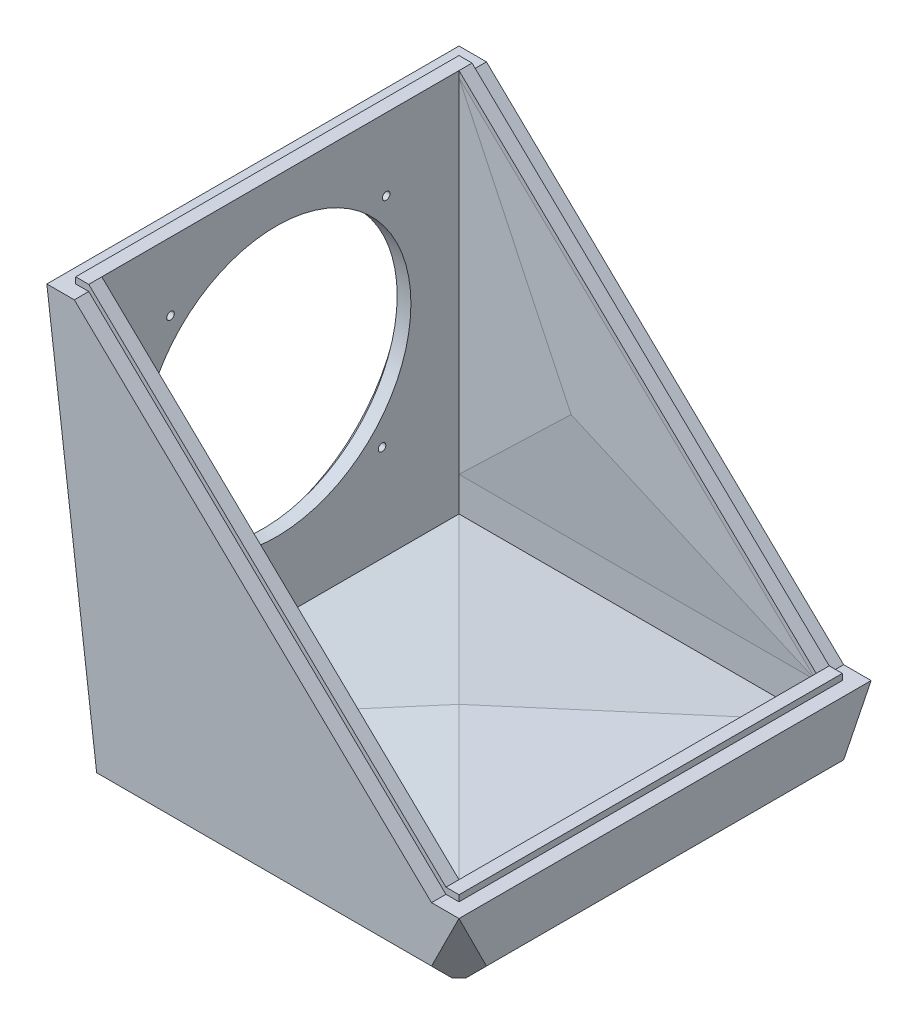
ISO-10303-21;
HEADER;
FILE_DESCRIPTION(('STEP AP214'),'2;1');
FILE_NAME('part.step','',(''),(''),'','','');
FILE_SCHEMA(('AUTOMOTIVE_DESIGN { 1 0 10303 214 1 1 1 1 }'));
ENDSEC;
DATA;
#1=APPLICATION_CONTEXT('core data for automotive mechanical design processes');
#2=APPLICATION_PROTOCOL_DEFINITION('international standard','automotive_design',2000,#1);
#3=PRODUCT_CONTEXT('',#1,'mechanical');
#4=PRODUCT('Part','Part','',(#3));
#5=PRODUCT_RELATED_PRODUCT_CATEGORY('part','',(#4));
#6=PRODUCT_DEFINITION_FORMATION('','',#4);
#7=PRODUCT_DEFINITION_CONTEXT('part definition',#1,'design');
#8=PRODUCT_DEFINITION('design','',#6,#7);
#9=PRODUCT_DEFINITION_SHAPE('','',#8);
#10=(LENGTH_UNIT() NAMED_UNIT(*) SI_UNIT(.MILLI.,.METRE.));
#11=(NAMED_UNIT(*) PLANE_ANGLE_UNIT() SI_UNIT($,.RADIAN.));
#12=(NAMED_UNIT(*) SI_UNIT($,.STERADIAN.) SOLID_ANGLE_UNIT());
#13=UNCERTAINTY_MEASURE_WITH_UNIT(LENGTH_MEASURE(1.E-05),#10,'distance_accuracy_value','');
#14=(GEOMETRIC_REPRESENTATION_CONTEXT(3) GLOBAL_UNCERTAINTY_ASSIGNED_CONTEXT((#13)) GLOBAL_UNIT_ASSIGNED_CONTEXT((#10,
#11,#12)) REPRESENTATION_CONTEXT('',''));
#15=CARTESIAN_POINT('',(0.,0.,0.));
#16=DIRECTION('',(0.,0.,1.));
#17=DIRECTION('',(1.,0.,0.));
#18=AXIS2_PLACEMENT_3D('',#15,#16,#17);
#19=CARTESIAN_POINT('',(-66.04,152.4,66.04));
#20=DIRECTION('',(-1.,0.,0.));
#21=DIRECTION('',(0.,0.,1.));
#22=AXIS2_PLACEMENT_3D('',#19,#20,#21);
#23=PLANE('',#22);
#24=CARTESIAN_POINT('',(-66.04,88.9,1.52276355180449));
#25=DIRECTION('',(1.,0.,0.));
#26=DIRECTION('',(0.,0.,-1.));
#27=AXIS2_PLACEMENT_3D('',#24,#25,#26);
#28=CIRCLE('',#27,49.784);
#29=CARTESIAN_POINT('',(-66.04,88.9,-48.2612364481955));
#30=VERTEX_POINT('',#29);
#31=EDGE_CURVE('E612',#30,#30,#28,.T.);
#32=ORIENTED_EDGE('',*,*,#31,.F.);
#33=EDGE_LOOP('',(#32));
#34=FACE_BOUND('',#33,.T.);
#35=CARTESIAN_POINT('',(-66.04,129.54,40.64));
#36=DIRECTION('',(1.,0.,0.));
#37=DIRECTION('',(0.,0.,-1.));
#38=AXIS2_PLACEMENT_3D('',#35,#36,#37);
#39=CIRCLE('',#38,1.39700000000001);
#40=CARTESIAN_POINT('',(-66.04,129.54,39.243));
#41=VERTEX_POINT('',#40);
#42=EDGE_CURVE('E606',#41,#41,#39,.T.);
#43=ORIENTED_EDGE('',*,*,#42,.F.);
#44=EDGE_LOOP('',(#43));
#45=FACE_BOUND('',#44,.T.);
#46=CARTESIAN_POINT('',(-66.04,49.7827635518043,42.1627635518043));
#47=DIRECTION('',(1.,0.,0.));
#48=DIRECTION('',(0.,1.,0.));
#49=AXIS2_PLACEMENT_3D('',#46,#47,#48);
#50=CIRCLE('',#49,1.39700000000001);
#51=CARTESIAN_POINT('',(-66.04,51.1797635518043,42.1627635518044));
#52=VERTEX_POINT('',#51);
#53=EDGE_CURVE('E600',#52,#52,#50,.T.);
#54=ORIENTED_EDGE('',*,*,#53,.F.);
#55=EDGE_LOOP('',(#54));
#56=FACE_BOUND('',#55,.T.);
#57=CARTESIAN_POINT('',(-66.04,48.26,-37.594472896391));
#58=DIRECTION('',(1.,0.,0.));
#59=DIRECTION('',(0.,0.,1.));
#60=AXIS2_PLACEMENT_3D('',#57,#58,#59);
#61=CIRCLE('',#60,1.39700000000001);
#62=CARTESIAN_POINT('',(-66.04,48.26,-36.197472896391));
#63=VERTEX_POINT('',#62);
#64=EDGE_CURVE('E593',#63,#63,#61,.T.);
#65=ORIENTED_EDGE('',*,*,#64,.F.);
#66=EDGE_LOOP('',(#65));
#67=FACE_BOUND('',#66,.T.);
#68=CARTESIAN_POINT('',(-66.04,128.017236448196,-39.1172364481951));
#69=DIRECTION('',(1.,0.,0.));
#70=DIRECTION('',(0.,-1.,0.));
#71=AXIS2_PLACEMENT_3D('',#68,#69,#70);
#72=CIRCLE('',#71,1.39700000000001);
#73=CARTESIAN_POINT('',(-66.04,126.620236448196,-39.1172364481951));
#74=VERTEX_POINT('',#73);
#75=EDGE_CURVE('E594',#74,#74,#72,.T.);
#76=ORIENTED_EDGE('',*,*,#75,.F.);
#77=EDGE_LOOP('',(#76));
#78=FACE_BOUND('',#77,.T.);
#79=DIRECTION('',(0.,-1.,0.));
#80=VECTOR('',#79,1.);
#81=CARTESIAN_POINT('',(-66.04,0.,48.2599999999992));
#82=LINE('',#81,#80);
#83=CARTESIAN_POINT('',(-66.04,22.86,48.2599999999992));
#84=VERTEX_POINT('',#83);
#85=CARTESIAN_POINT('',(-66.0399999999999,12.7,48.2599999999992));
#86=VERTEX_POINT('',#85);
#87=EDGE_CURVE('E63',#84,#86,#82,.T.);
#88=ORIENTED_EDGE('',*,*,#87,.F.);
#89=CARTESIAN_POINT('',(-66.04,22.86,40.6399999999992));
#90=DIRECTION('',(1.,0.,0.));
#91=DIRECTION('',(0.,0.,-1.));
#92=AXIS2_PLACEMENT_3D('',#89,#90,#91);
#93=CIRCLE('',#92,7.62);
#94=CARTESIAN_POINT('',(-66.04,22.86,33.0199999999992));
#95=VERTEX_POINT('',#94);
#96=EDGE_CURVE('E68',#84,#95,#93,.F.);
#97=ORIENTED_EDGE('',*,*,#96,.T.);
#98=DIRECTION('',(0.,-1.,0.));
#99=VECTOR('',#98,1.);
#100=CARTESIAN_POINT('',(-66.04,0.,33.0199999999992));
#101=LINE('',#100,#99);
#102=CARTESIAN_POINT('',(-66.0399999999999,12.7,33.0199999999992));
#103=VERTEX_POINT('',#102);
#104=EDGE_CURVE('E286',#95,#103,#101,.T.);
#105=ORIENTED_EDGE('',*,*,#104,.T.);
#106=DIRECTION('',(0.,0.,1.));
#107=VECTOR('',#106,1.);
#108=CARTESIAN_POINT('',(-66.0399999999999,12.7,-66.04));
#109=LINE('',#108,#107);
#110=CARTESIAN_POINT('',(-66.0399999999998,12.7,-66.0400000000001));
#111=VERTEX_POINT('',#110);
#112=EDGE_CURVE('E423',#111,#103,#109,.T.);
#113=ORIENTED_EDGE('',*,*,#112,.F.);
#114=DIRECTION('',(0.,1.,0.));
#115=VECTOR('',#114,1.);
#116=CARTESIAN_POINT('',(-66.0399999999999,12.7,-66.04));
#117=LINE('',#116,#115);
#118=CARTESIAN_POINT('',(-66.0399999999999,25.4,-66.04));
#119=VERTEX_POINT('',#118);
#120=EDGE_CURVE('E661',#111,#119,#117,.T.);
#121=ORIENTED_EDGE('',*,*,#120,.T.);
#122=DIRECTION('',(0.,-1.,0.));
#123=VECTOR('',#122,1.);
#124=CARTESIAN_POINT('',(-66.04,152.4,-66.04));
#125=LINE('',#124,#123);
#126=CARTESIAN_POINT('',(-66.04,152.4,-66.04));
#127=VERTEX_POINT('',#126);
#128=EDGE_CURVE('E517',#127,#119,#125,.T.);
#129=ORIENTED_EDGE('',*,*,#128,.F.);
#130=DIRECTION('',(0.,-1.,0.));
#131=VECTOR('',#130,1.);
#132=CARTESIAN_POINT('',(-66.04,154.686,-66.04));
#133=LINE('',#132,#131);
#134=CARTESIAN_POINT('',(-66.04,154.686,-66.04));
#135=VERTEX_POINT('',#134);
#136=EDGE_CURVE('E323',#135,#127,#133,.T.);
#137=ORIENTED_EDGE('',*,*,#136,.F.);
#138=DIRECTION('',(0.,0.,-1.));
#139=VECTOR('',#138,1.);
#140=CARTESIAN_POINT('',(-66.04,154.686,66.04));
#141=LINE('',#140,#139);
#142=CARTESIAN_POINT('',(-66.04,154.686,66.04));
#143=VERTEX_POINT('',#142);
#144=EDGE_CURVE('E364',#143,#135,#141,.T.);
#145=ORIENTED_EDGE('',*,*,#144,.F.);
#146=DIRECTION('',(0.,-1.,0.));
#147=VECTOR('',#146,1.);
#148=CARTESIAN_POINT('',(-66.04,154.686,66.04));
#149=LINE('',#148,#147);
#150=CARTESIAN_POINT('',(-66.04,152.4,66.04));
#151=VERTEX_POINT('',#150);
#152=EDGE_CURVE('E339',#143,#151,#149,.T.);
#153=ORIENTED_EDGE('',*,*,#152,.T.);
#154=DIRECTION('',(0.,-1.,0.));
#155=VECTOR('',#154,1.);
#156=CARTESIAN_POINT('',(-66.04,152.4,66.04));
#157=LINE('',#156,#155);
#158=CARTESIAN_POINT('',(-66.0399999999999,25.4,66.04));
#159=VERTEX_POINT('',#158);
#160=EDGE_CURVE('E461',#151,#159,#157,.T.);
#161=ORIENTED_EDGE('',*,*,#160,.T.);
#162=DIRECTION('',(0.,1.,0.));
#163=VECTOR('',#162,1.);
#164=CARTESIAN_POINT('',(-66.0399999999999,12.7,66.04));
#165=LINE('',#164,#163);
#166=CARTESIAN_POINT('',(-66.0400000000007,12.7,66.0399999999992));
#167=VERTEX_POINT('',#166);
#168=EDGE_CURVE('E431',#167,#159,#165,.T.);
#169=ORIENTED_EDGE('',*,*,#168,.F.);
#170=EDGE_CURVE('E421',#86,#167,#109,.T.);
#171=ORIENTED_EDGE('',*,*,#170,.F.);
#172=EDGE_LOOP('',(#88,#97,#105,#113,#121,#129,#137,#145,#153,#161,#169,#171));
#173=FACE_BOUND('',#172,.T.);
#174=ADVANCED_FACE('F48',(#34,#45,#56,#67,#78,#173),#23,.F.);
#175=CARTESIAN_POINT('',(-1.35964705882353,17.6754117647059,0.));
#176=DIRECTION('',(0.0766964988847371,-0.997054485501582,0.));
#177=DIRECTION('',(0.997054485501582,0.0766964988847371,0.));
#178=AXIS2_PLACEMENT_3D('',#175,#176,#177);
#179=PLANE('',#178);
#180=DIRECTION('',(0.997054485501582,0.0766964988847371,0.));
#181=VECTOR('',#180,1.);
#182=CARTESIAN_POINT('',(-1.35964705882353,17.6754117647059,48.2599999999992));
#183=LINE('',#182,#181);
#184=CARTESIAN_POINT('',(-48.2599999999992,14.0676923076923,48.2599999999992));
#185=VERTEX_POINT('',#184);
#186=EDGE_CURVE('E301',#86,#185,#183,.T.);
#187=ORIENTED_EDGE('',*,*,#186,.F.);
#188=ORIENTED_EDGE('',*,*,#170,.T.);
#189=DIRECTION('',(0.706063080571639,0.0543125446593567,-0.706063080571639));
#190=VECTOR('',#189,1.);
#191=CARTESIAN_POINT('',(-66.0399999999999,12.7,66.04));
#192=LINE('',#191,#190);
#193=EDGE_CURVE('E405',#167,#185,#192,.T.);
#194=ORIENTED_EDGE('',*,*,#193,.T.);
#195=EDGE_LOOP('',(#187,#188,#194));
#196=FACE_BOUND('',#195,.T.);
#197=ADVANCED_FACE('F685',(#196),#179,.F.);
#198=CARTESIAN_POINT('',(0.,17.6754117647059,1.35964705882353));
#199=DIRECTION('',(0.,0.997054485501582,0.0766964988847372));
#200=DIRECTION('',(0.,-0.0766964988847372,0.997054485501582));
#201=AXIS2_PLACEMENT_3D('',#198,#199,#200);
#202=PLANE('',#201);
#203=DIRECTION('',(0.,0.0766964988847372,-0.997054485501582));
#204=VECTOR('',#203,1.);
#205=CARTESIAN_POINT('',(-40.64,17.6754117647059,1.35964705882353));
#206=LINE('',#205,#204);
#207=CARTESIAN_POINT('',(-40.64,14.0676923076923,48.2599999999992));
#208=VERTEX_POINT('',#207);
#209=CARTESIAN_POINT('',(-40.64,14.6538461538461,40.6400000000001));
#210=VERTEX_POINT('',#209);
#211=EDGE_CURVE('E418',#208,#210,#206,.T.);
#212=ORIENTED_EDGE('',*,*,#211,.F.);
#213=DIRECTION('',(-1.,0.,0.));
#214=VECTOR('',#213,1.);
#215=CARTESIAN_POINT('',(0.,14.0676923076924,48.2599999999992));
#216=LINE('',#215,#214);
#217=EDGE_CURVE('E56',#208,#185,#216,.T.);
#218=ORIENTED_EDGE('',*,*,#217,.T.);
#219=ORIENTED_EDGE('',*,*,#193,.F.);
#220=DIRECTION('',(1.,0.,0.));
#221=VECTOR('',#220,1.);
#222=CARTESIAN_POINT('',(-66.0399999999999,12.7,66.04));
#223=LINE('',#222,#221);
#224=CARTESIAN_POINT('',(66.0399999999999,12.7,66.04));
#225=VERTEX_POINT('',#224);
#226=EDGE_CURVE('E437',#167,#225,#223,.T.);
#227=ORIENTED_EDGE('',*,*,#226,.T.);
#228=DIRECTION('',(0.706063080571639,-0.0543125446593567,0.706063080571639));
#229=VECTOR('',#228,1.);
#230=CARTESIAN_POINT('',(0.,17.78,0.));
#231=LINE('',#230,#229);
#232=CARTESIAN_POINT('',(0.,17.78,0.));
#233=VERTEX_POINT('',#232);
#234=EDGE_CURVE('E395',#233,#225,#231,.T.);
#235=ORIENTED_EDGE('',*,*,#234,.F.);
#236=EDGE_CURVE('E402',#210,#233,#192,.T.);
#237=ORIENTED_EDGE('',*,*,#236,.F.);
#238=EDGE_LOOP('',(#212,#218,#219,#227,#235,#237));
#239=FACE_BOUND('',#238,.T.);
#240=ADVANCED_FACE('F691',(#239),#202,.T.);
#241=CARTESIAN_POINT('',(-66.04,152.4,66.04));
#242=DIRECTION('',(0.693108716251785,0.720833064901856,0.));
#243=DIRECTION('',(-0.720833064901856,0.693108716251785,0.));
#244=AXIS2_PLACEMENT_3D('',#241,#242,#243);
#245=PLANE('',#244);
#246=DIRECTION('',(0.,0.,1.));
#247=VECTOR('',#246,1.);
#248=CARTESIAN_POINT('',(66.04,25.4,66.04));
#249=LINE('',#248,#247);
#250=CARTESIAN_POINT('',(66.04,25.4,70.866));
#251=VERTEX_POINT('',#250);
#252=CARTESIAN_POINT('',(66.0399999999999,25.4,76.2));
#253=VERTEX_POINT('',#252);
#254=EDGE_CURVE('E445',#251,#253,#249,.T.);
#255=ORIENTED_EDGE('',*,*,#254,.F.);
#256=DIRECTION('',(0.720833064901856,-0.693108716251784,0.));
#257=VECTOR('',#256,1.);
#258=CARTESIAN_POINT('',(66.04,25.4,70.866));
#259=LINE('',#258,#257);
#260=CARTESIAN_POINT('',(-66.04,152.4,70.866));
#261=VERTEX_POINT('',#260);
#262=EDGE_CURVE('E313',#261,#251,#259,.T.);
#263=ORIENTED_EDGE('',*,*,#262,.F.);
#264=DIRECTION('',(0.,0.,1.));
#265=VECTOR('',#264,1.);
#266=CARTESIAN_POINT('',(-66.04,152.4,66.04));
#267=LINE('',#266,#265);
#268=CARTESIAN_POINT('',(-66.04,152.4,76.2));
#269=VERTEX_POINT('',#268);
#270=EDGE_CURVE('E465',#261,#269,#267,.T.);
#271=ORIENTED_EDGE('',*,*,#270,.T.);
#272=DIRECTION('',(-0.720833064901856,0.693108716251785,0.));
#273=VECTOR('',#272,1.);
#274=CARTESIAN_POINT('',(-66.04,152.4,76.2));
#275=LINE('',#274,#273);
#276=EDGE_CURVE('E443',#253,#269,#275,.T.);
#277=ORIENTED_EDGE('',*,*,#276,.F.);
#278=EDGE_LOOP('',(#255,#263,#271,#277));
#279=FACE_BOUND('',#278,.T.);
#280=ADVANCED_FACE('F705',(#279),#245,.T.);
#281=CARTESIAN_POINT('',(66.04,12.7,-66.04));
#282=DIRECTION('',(1.,0.,0.));
#283=DIRECTION('',(0.,0.,-1.));
#284=AXIS2_PLACEMENT_3D('',#281,#282,#283);
#285=PLANE('',#284);
#286=DIRECTION('',(0.,0.,-1.));
#287=VECTOR('',#286,1.);
#288=CARTESIAN_POINT('',(66.04,27.686,-66.04));
#289=LINE('',#288,#287);
#290=CARTESIAN_POINT('',(66.04,27.686,66.04));
#291=VERTEX_POINT('',#290);
#292=CARTESIAN_POINT('',(66.04,27.686,-66.04));
#293=VERTEX_POINT('',#292);
#294=EDGE_CURVE('E371',#291,#293,#289,.T.);
#295=ORIENTED_EDGE('',*,*,#294,.T.);
#296=DIRECTION('',(0.,-1.,0.));
#297=VECTOR('',#296,1.);
#298=CARTESIAN_POINT('',(66.04,27.686,-66.04));
#299=LINE('',#298,#297);
#300=CARTESIAN_POINT('',(66.04,25.4,-66.04));
#301=VERTEX_POINT('',#300);
#302=EDGE_CURVE('E303',#293,#301,#299,.T.);
#303=ORIENTED_EDGE('',*,*,#302,.T.);
#304=DIRECTION('',(0.,1.,0.));
#305=VECTOR('',#304,1.);
#306=CARTESIAN_POINT('',(66.04,12.7,-66.04));
#307=LINE('',#306,#305);
#308=CARTESIAN_POINT('',(66.0400000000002,12.7,-66.0399999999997));
#309=VERTEX_POINT('',#308);
#310=EDGE_CURVE('E656',#309,#301,#307,.T.);
#311=ORIENTED_EDGE('',*,*,#310,.F.);
#312=DIRECTION('',(0.,0.,-1.));
#313=VECTOR('',#312,1.);
#314=CARTESIAN_POINT('',(66.04,12.7,-66.04));
#315=LINE('',#314,#313);
#316=EDGE_CURVE('E432',#225,#309,#315,.T.);
#317=ORIENTED_EDGE('',*,*,#316,.F.);
#318=DIRECTION('',(0.,1.,0.));
#319=VECTOR('',#318,1.);
#320=CARTESIAN_POINT('',(66.04,12.7,66.04));
#321=LINE('',#320,#319);
#322=CARTESIAN_POINT('',(66.04,25.4,66.04));
#323=VERTEX_POINT('',#322);
#324=EDGE_CURVE('E651',#225,#323,#321,.T.);
#325=ORIENTED_EDGE('',*,*,#324,.T.);
#326=DIRECTION('',(0.,-1.,0.));
#327=VECTOR('',#326,1.);
#328=CARTESIAN_POINT('',(66.04,27.686,66.04));
#329=LINE('',#328,#327);
#330=EDGE_CURVE('E342',#291,#323,#329,.T.);
#331=ORIENTED_EDGE('',*,*,#330,.F.);
#332=EDGE_LOOP('',(#295,#303,#311,#317,#325,#331));
#333=FACE_BOUND('',#332,.T.);
#334=ADVANCED_FACE('F708',(#333),#285,.F.);
#335=CARTESIAN_POINT('',(-76.2,25.4,-76.2));
#336=DIRECTION('',(0.,0.,1.));
#337=DIRECTION('',(1.,0.,0.));
#338=AXIS2_PLACEMENT_3D('',#335,#336,#337);
#339=PLANE('',#338);
#340=DIRECTION('',(-0.447213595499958,-0.894427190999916,0.));
#341=VECTOR('',#340,1.);
#342=CARTESIAN_POINT('',(76.2,25.4,-76.2));
#343=LINE('',#342,#341);
#344=CARTESIAN_POINT('',(76.2,25.4,-76.2));
#345=VERTEX_POINT('',#344);
#346=CARTESIAN_POINT('',(66.04,5.08000000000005,-76.2));
#347=VERTEX_POINT('',#346);
#348=EDGE_CURVE('E551',#345,#347,#343,.T.);
#349=ORIENTED_EDGE('',*,*,#348,.T.);
#350=DIRECTION('',(-1.,0.,0.));
#351=VECTOR('',#350,1.);
#352=CARTESIAN_POINT('',(-57.15,5.08000000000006,-76.2));
#353=LINE('',#352,#351);
#354=CARTESIAN_POINT('',(-57.785,5.08,-76.2));
#355=VERTEX_POINT('',#354);
#356=EDGE_CURVE('E754',#347,#355,#353,.T.);
#357=ORIENTED_EDGE('',*,*,#356,.T.);
#358=DIRECTION('',(0.124034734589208,-0.992277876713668,0.));
#359=VECTOR('',#358,1.);
#360=CARTESIAN_POINT('',(-76.2,152.4,-76.2));
#361=LINE('',#360,#359);
#362=CARTESIAN_POINT('',(-76.2,152.4,-76.2));
#363=VERTEX_POINT('',#362);
#364=EDGE_CURVE('E512',#363,#355,#361,.T.);
#365=ORIENTED_EDGE('',*,*,#364,.F.);
#366=DIRECTION('',(-1.,0.,0.));
#367=VECTOR('',#366,1.);
#368=CARTESIAN_POINT('',(-76.2,152.4,-76.2));
#369=LINE('',#368,#367);
#370=CARTESIAN_POINT('',(-66.04,152.4,-76.2));
#371=VERTEX_POINT('',#370);
#372=EDGE_CURVE('E505',#371,#363,#369,.T.);
#373=ORIENTED_EDGE('',*,*,#372,.F.);
#374=DIRECTION('',(-0.720833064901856,0.693108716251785,0.));
#375=VECTOR('',#374,1.);
#376=CARTESIAN_POINT('',(-66.04,152.4,-76.2));
#377=LINE('',#376,#375);
#378=CARTESIAN_POINT('',(66.04,25.4,-76.2));
#379=VERTEX_POINT('',#378);
#380=EDGE_CURVE('E499',#379,#371,#377,.T.);
#381=ORIENTED_EDGE('',*,*,#380,.F.);
#382=DIRECTION('',(-1.,0.,0.));
#383=VECTOR('',#382,1.);
#384=CARTESIAN_POINT('',(-76.2,25.4,-76.2));
#385=LINE('',#384,#383);
#386=EDGE_CURVE('E530',#345,#379,#385,.T.);
#387=ORIENTED_EDGE('',*,*,#386,.F.);
#388=EDGE_LOOP('',(#349,#357,#365,#373,#381,#387));
#389=FACE_BOUND('',#388,.T.);
#390=ADVANCED_FACE('F509',(#389),#339,.F.);
#391=CARTESIAN_POINT('',(-76.2,25.4,76.2));
#392=DIRECTION('',(1.,0.,0.));
#393=DIRECTION('',(0.,0.,-1.));
#394=AXIS2_PLACEMENT_3D('',#391,#392,#393);
#395=PLANE('',#394);
#396=CARTESIAN_POINT('',(-76.2,22.86,40.6399999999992));
#397=DIRECTION('',(1.,0.,0.));
#398=DIRECTION('',(0.,0.,-1.));
#399=AXIS2_PLACEMENT_3D('',#396,#397,#398);
#400=CIRCLE('',#399,6.35);
#401=CARTESIAN_POINT('',(-76.2,22.86,34.2899999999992));
#402=VERTEX_POINT('',#401);
#403=EDGE_CURVE('E290',#402,#402,#400,.F.);
#404=ORIENTED_EDGE('',*,*,#403,.F.);
#405=EDGE_LOOP('',(#404));
#406=FACE_BOUND('',#405,.T.);
#407=CARTESIAN_POINT('',(-76.2,88.9,1.52276355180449));
#408=DIRECTION('',(1.,0.,0.));
#409=DIRECTION('',(0.,0.,-1.));
#410=AXIS2_PLACEMENT_3D('',#407,#408,#409);
#411=CIRCLE('',#410,56.2861034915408);
#412=CARTESIAN_POINT('',(-76.2,88.9,-54.7633399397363));
#413=VERTEX_POINT('',#412);
#414=EDGE_CURVE('E622',#413,#413,#411,.T.);
#415=ORIENTED_EDGE('',*,*,#414,.T.);
#416=EDGE_LOOP('',(#415));
#417=FACE_BOUND('',#416,.T.);
#418=DIRECTION('',(0.,-0.992277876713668,0.124034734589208));
#419=VECTOR('',#418,1.);
#420=CARTESIAN_POINT('',(-76.2,152.4,-76.2));
#421=LINE('',#420,#419);
#422=CARTESIAN_POINT('',(-76.2,5.08000000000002,-57.785));
#423=VERTEX_POINT('',#422);
#424=EDGE_CURVE('E571',#363,#423,#421,.T.);
#425=ORIENTED_EDGE('',*,*,#424,.T.);
#426=DIRECTION('',(0.,0.,1.));
#427=VECTOR('',#426,1.);
#428=CARTESIAN_POINT('',(-76.2,5.08000000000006,57.15));
#429=LINE('',#428,#427);
#430=CARTESIAN_POINT('',(-76.1999999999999,5.07999999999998,57.785));
#431=VERTEX_POINT('',#430);
#432=EDGE_CURVE('E420',#423,#431,#429,.T.);
#433=ORIENTED_EDGE('',*,*,#432,.T.);
#434=DIRECTION('',(0.,-0.992277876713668,-0.124034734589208));
#435=VECTOR('',#434,1.);
#436=CARTESIAN_POINT('',(-76.2,152.4,76.2));
#437=LINE('',#436,#435);
#438=CARTESIAN_POINT('',(-76.2,152.4,76.2));
#439=VERTEX_POINT('',#438);
#440=EDGE_CURVE('E561',#439,#431,#437,.T.);
#441=ORIENTED_EDGE('',*,*,#440,.F.);
#442=DIRECTION('',(0.,0.,1.));
#443=VECTOR('',#442,1.);
#444=CARTESIAN_POINT('',(-76.2,152.4,66.04));
#445=LINE('',#444,#443);
#446=EDGE_CURVE('E538',#363,#439,#445,.T.);
#447=ORIENTED_EDGE('',*,*,#446,.F.);
#448=EDGE_LOOP('',(#425,#433,#441,#447));
#449=FACE_BOUND('',#448,.T.);
#450=ADVANCED_FACE('F716',(#406,#417,#449),#395,.F.);
#451=CARTESIAN_POINT('',(0.,0.,0.));
#452=DIRECTION('',(0.,-1.,0.));
#453=DIRECTION('',(0.,0.,-1.));
#454=AXIS2_PLACEMENT_3D('',#451,#452,#453);
#455=PLANE('',#454);
#456=DIRECTION('',(0.707106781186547,0.,0.707106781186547));
#457=VECTOR('',#456,1.);
#458=CARTESIAN_POINT('',(63.5,0.,-76.2));
#459=LINE('',#458,#457);
#460=CARTESIAN_POINT('',(68.58,0.,-71.12));
#461=VERTEX_POINT('',#460);
#462=CARTESIAN_POINT('',(71.12,0.,-68.5800000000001));
#463=VERTEX_POINT('',#462);
#464=EDGE_CURVE('E546',#461,#463,#459,.T.);
#465=ORIENTED_EDGE('',*,*,#464,.T.);
#466=DIRECTION('',(0.,0.,1.));
#467=VECTOR('',#466,1.);
#468=CARTESIAN_POINT('',(71.12,0.,63.5));
#469=LINE('',#468,#467);
#470=CARTESIAN_POINT('',(71.12,0.,68.58));
#471=VERTEX_POINT('',#470);
#472=EDGE_CURVE('E763',#463,#471,#469,.T.);
#473=ORIENTED_EDGE('',*,*,#472,.T.);
#474=DIRECTION('',(0.707106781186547,0.,-0.707106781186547));
#475=VECTOR('',#474,1.);
#476=CARTESIAN_POINT('',(63.5,0.,76.2));
#477=LINE('',#476,#475);
#478=CARTESIAN_POINT('',(68.5800000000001,0.,71.1199999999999));
#479=VERTEX_POINT('',#478);
#480=EDGE_CURVE('E577',#479,#471,#477,.T.);
#481=ORIENTED_EDGE('',*,*,#480,.F.);
#482=DIRECTION('',(-1.,0.,0.));
#483=VECTOR('',#482,1.);
#484=CARTESIAN_POINT('',(-57.15,0.,71.1199999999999));
#485=LINE('',#484,#483);
#486=CARTESIAN_POINT('',(-62.23,0.,71.12));
#487=VERTEX_POINT('',#486);
#488=EDGE_CURVE('E762',#479,#487,#485,.T.);
#489=ORIENTED_EDGE('',*,*,#488,.T.);
#490=DIRECTION('',(0.707106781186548,0.,0.707106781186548));
#491=VECTOR('',#490,1.);
#492=CARTESIAN_POINT('',(-76.2,0.,57.15));
#493=LINE('',#492,#491);
#494=CARTESIAN_POINT('',(-71.1199999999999,0.,62.2300000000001));
#495=VERTEX_POINT('',#494);
#496=EDGE_CURVE('E562',#495,#487,#493,.T.);
#497=ORIENTED_EDGE('',*,*,#496,.F.);
#498=DIRECTION('',(0.,0.,-1.));
#499=VECTOR('',#498,1.);
#500=CARTESIAN_POINT('',(-71.1199999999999,0.,-57.1499999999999));
#501=LINE('',#500,#499);
#502=CARTESIAN_POINT('',(-71.12,0.,-62.23));
#503=VERTEX_POINT('',#502);
#504=EDGE_CURVE('E583',#495,#503,#501,.T.);
#505=ORIENTED_EDGE('',*,*,#504,.T.);
#506=DIRECTION('',(0.707106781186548,0.,-0.707106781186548));
#507=VECTOR('',#506,1.);
#508=CARTESIAN_POINT('',(-76.2,0.,-57.15));
#509=LINE('',#508,#507);
#510=CARTESIAN_POINT('',(-62.23,0.,-71.1199999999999));
#511=VERTEX_POINT('',#510);
#512=EDGE_CURVE('E579',#503,#511,#509,.T.);
#513=ORIENTED_EDGE('',*,*,#512,.T.);
#514=DIRECTION('',(1.,0.,0.));
#515=VECTOR('',#514,1.);
#516=CARTESIAN_POINT('',(63.4999999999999,0.,-71.1199999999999));
#517=LINE('',#516,#515);
#518=EDGE_CURVE('E753',#511,#461,#517,.T.);
#519=ORIENTED_EDGE('',*,*,#518,.T.);
#520=EDGE_LOOP('',(#465,#473,#481,#489,#497,#505,#513,#519));
#521=FACE_BOUND('',#520,.T.);
#522=ADVANCED_FACE('F713',(#521),#455,.T.);
#523=CARTESIAN_POINT('',(-76.2,25.4,76.2));
#524=DIRECTION('',(0.,0.,-1.));
#525=DIRECTION('',(-1.,0.,0.));
#526=AXIS2_PLACEMENT_3D('',#523,#524,#525);
#527=PLANE('',#526);
#528=DIRECTION('',(0.124034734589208,-0.992277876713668,0.));
#529=VECTOR('',#528,1.);
#530=CARTESIAN_POINT('',(-76.2,152.4,76.2));
#531=LINE('',#530,#529);
#532=CARTESIAN_POINT('',(-57.785,5.08000000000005,76.2));
#533=VERTEX_POINT('',#532);
#534=EDGE_CURVE('E558',#439,#533,#531,.T.);
#535=ORIENTED_EDGE('',*,*,#534,.T.);
#536=DIRECTION('',(1.,0.,0.));
#537=VECTOR('',#536,1.);
#538=CARTESIAN_POINT('',(63.4999999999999,5.08000000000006,76.2));
#539=LINE('',#538,#537);
#540=CARTESIAN_POINT('',(66.04,5.08000000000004,76.2));
#541=VERTEX_POINT('',#540);
#542=EDGE_CURVE('E771',#533,#541,#539,.T.);
#543=ORIENTED_EDGE('',*,*,#542,.T.);
#544=DIRECTION('',(-0.447213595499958,-0.894427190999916,0.));
#545=VECTOR('',#544,1.);
#546=CARTESIAN_POINT('',(76.2,25.4,76.2));
#547=LINE('',#546,#545);
#548=CARTESIAN_POINT('',(76.2,25.4,76.2));
#549=VERTEX_POINT('',#548);
#550=EDGE_CURVE('E855',#549,#541,#547,.T.);
#551=ORIENTED_EDGE('',*,*,#550,.F.);
#552=DIRECTION('',(1.,0.,0.));
#553=VECTOR('',#552,1.);
#554=CARTESIAN_POINT('',(-76.2,25.4,76.2));
#555=LINE('',#554,#553);
#556=EDGE_CURVE('E532',#253,#549,#555,.T.);
#557=ORIENTED_EDGE('',*,*,#556,.F.);
#558=ORIENTED_EDGE('',*,*,#276,.T.);
#559=DIRECTION('',(-1.,0.,0.));
#560=VECTOR('',#559,1.);
#561=CARTESIAN_POINT('',(-76.2,152.4,76.2));
#562=LINE('',#561,#560);
#563=EDGE_CURVE('E524',#269,#439,#562,.T.);
#564=ORIENTED_EDGE('',*,*,#563,.T.);
#565=EDGE_LOOP('',(#535,#543,#551,#557,#558,#564));
#566=FACE_BOUND('',#565,.T.);
#567=ADVANCED_FACE('F712',(#566),#527,.F.);
#568=CARTESIAN_POINT('',(0.,25.4,0.));
#569=DIRECTION('',(0.,-1.,0.));
#570=DIRECTION('',(0.,0.,-1.));
#571=AXIS2_PLACEMENT_3D('',#568,#569,#570);
#572=PLANE('',#571);
#573=DIRECTION('',(0.,0.,-1.));
#574=VECTOR('',#573,1.);
#575=CARTESIAN_POINT('',(66.04,25.4,-66.04));
#576=LINE('',#575,#574);
#577=CARTESIAN_POINT('',(66.04,25.4,-70.866));
#578=VERTEX_POINT('',#577);
#579=EDGE_CURVE('E440',#578,#379,#576,.T.);
#580=ORIENTED_EDGE('',*,*,#579,.F.);
#581=DIRECTION('',(1.,0.,0.));
#582=VECTOR('',#581,1.);
#583=CARTESIAN_POINT('',(66.04,25.4,-70.866));
#584=LINE('',#583,#582);
#585=CARTESIAN_POINT('',(70.866,25.4,-70.866));
#586=VERTEX_POINT('',#585);
#587=EDGE_CURVE('E387',#578,#586,#584,.T.);
#588=ORIENTED_EDGE('',*,*,#587,.T.);
#589=DIRECTION('',(0.,0.,-1.));
#590=VECTOR('',#589,1.);
#591=CARTESIAN_POINT('',(70.866,25.4,70.866));
#592=LINE('',#591,#590);
#593=CARTESIAN_POINT('',(70.866,25.4,70.866));
#594=VERTEX_POINT('',#593);
#595=EDGE_CURVE('E383',#594,#586,#592,.T.);
#596=ORIENTED_EDGE('',*,*,#595,.F.);
#597=DIRECTION('',(1.,0.,0.));
#598=VECTOR('',#597,1.);
#599=CARTESIAN_POINT('',(66.04,25.4,70.866));
#600=LINE('',#599,#598);
#601=EDGE_CURVE('E1375',#251,#594,#600,.T.);
#602=ORIENTED_EDGE('',*,*,#601,.F.);
#603=ORIENTED_EDGE('',*,*,#254,.T.);
#604=ORIENTED_EDGE('',*,*,#556,.T.);
#605=DIRECTION('',(0.,0.,-1.));
#606=VECTOR('',#605,1.);
#607=CARTESIAN_POINT('',(76.2,25.4,76.2));
#608=LINE('',#607,#606);
#609=EDGE_CURVE('E533',#549,#345,#608,.T.);
#610=ORIENTED_EDGE('',*,*,#609,.T.);
#611=ORIENTED_EDGE('',*,*,#386,.T.);
#612=EDGE_LOOP('',(#580,#588,#596,#602,#603,#604,#610,#611));
#613=FACE_BOUND('',#612,.T.);
#614=ADVANCED_FACE('F709',(#613),#572,.F.);
#615=CARTESIAN_POINT('',(76.2,25.4,76.2));
#616=DIRECTION('',(-1.,0.,0.));
#617=DIRECTION('',(0.,0.,1.));
#618=AXIS2_PLACEMENT_3D('',#615,#616,#617);
#619=PLANE('',#618);
#620=DIRECTION('',(0.,-0.894427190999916,-0.447213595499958));
#621=VECTOR('',#620,1.);
#622=CARTESIAN_POINT('',(76.2,25.4,76.2));
#623=LINE('',#622,#621);
#624=CARTESIAN_POINT('',(76.2,5.08,66.04));
#625=VERTEX_POINT('',#624);
#626=EDGE_CURVE('E852',#549,#625,#623,.T.);
#627=ORIENTED_EDGE('',*,*,#626,.T.);
#628=DIRECTION('',(0.,0.,-1.));
#629=VECTOR('',#628,1.);
#630=CARTESIAN_POINT('',(76.2,5.08000000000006,-63.4999999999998));
#631=LINE('',#630,#629);
#632=CARTESIAN_POINT('',(76.2,5.08000000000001,-66.04));
#633=VERTEX_POINT('',#632);
#634=EDGE_CURVE('E541',#625,#633,#631,.T.);
#635=ORIENTED_EDGE('',*,*,#634,.T.);
#636=DIRECTION('',(0.,-0.894427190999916,0.447213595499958));
#637=VECTOR('',#636,1.);
#638=CARTESIAN_POINT('',(76.2,25.4,-76.2));
#639=LINE('',#638,#637);
#640=EDGE_CURVE('E550',#345,#633,#639,.T.);
#641=ORIENTED_EDGE('',*,*,#640,.F.);
#642=ORIENTED_EDGE('',*,*,#609,.F.);
#643=EDGE_LOOP('',(#627,#635,#641,#642));
#644=FACE_BOUND('',#643,.T.);
#645=ADVANCED_FACE('F704',(#644),#619,.F.);
#646=CARTESIAN_POINT('',(-76.2,152.4,66.04));
#647=DIRECTION('',(0.,1.,0.));
#648=DIRECTION('',(0.,0.,1.));
#649=AXIS2_PLACEMENT_3D('',#646,#647,#648);
#650=PLANE('',#649);
#651=DIRECTION('',(-1.,0.,0.));
#652=VECTOR('',#651,1.);
#653=CARTESIAN_POINT('',(-70.866,152.4,-70.866));
#654=LINE('',#653,#652);
#655=CARTESIAN_POINT('',(-66.04,152.4,-70.866));
#656=VERTEX_POINT('',#655);
#657=CARTESIAN_POINT('',(-70.866,152.4,-70.866));
#658=VERTEX_POINT('',#657);
#659=EDGE_CURVE('E348',#656,#658,#654,.T.);
#660=ORIENTED_EDGE('',*,*,#659,.F.);
#661=DIRECTION('',(0.,0.,-1.));
#662=VECTOR('',#661,1.);
#663=CARTESIAN_POINT('',(-66.04,152.4,-66.04));
#664=LINE('',#663,#662);
#665=EDGE_CURVE('E444',#656,#371,#664,.T.);
#666=ORIENTED_EDGE('',*,*,#665,.T.);
#667=ORIENTED_EDGE('',*,*,#372,.T.);
#668=ORIENTED_EDGE('',*,*,#446,.T.);
#669=ORIENTED_EDGE('',*,*,#563,.F.);
#670=ORIENTED_EDGE('',*,*,#270,.F.);
#671=DIRECTION('',(1.,0.,0.));
#672=VECTOR('',#671,1.);
#673=CARTESIAN_POINT('',(-66.04,152.4,70.866));
#674=LINE('',#673,#672);
#675=CARTESIAN_POINT('',(-70.866,152.4,70.866));
#676=VERTEX_POINT('',#675);
#677=EDGE_CURVE('E471',#676,#261,#674,.T.);
#678=ORIENTED_EDGE('',*,*,#677,.F.);
#679=DIRECTION('',(0.,0.,1.));
#680=VECTOR('',#679,1.);
#681=CARTESIAN_POINT('',(-70.866,152.4,70.866));
#682=LINE('',#681,#680);
#683=EDGE_CURVE('E469',#658,#676,#682,.T.);
#684=ORIENTED_EDGE('',*,*,#683,.F.);
#685=EDGE_LOOP('',(#660,#666,#667,#668,#669,#670,#678,#684));
#686=FACE_BOUND('',#685,.T.);
#687=ADVANCED_FACE('F493',(#686),#650,.T.);
#688=CARTESIAN_POINT('',(-66.04,152.4,-66.04));
#689=DIRECTION('',(-0.693108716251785,-0.720833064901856,0.));
#690=DIRECTION('',(0.720833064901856,-0.693108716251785,0.));
#691=AXIS2_PLACEMENT_3D('',#688,#689,#690);
#692=PLANE('',#691);
#693=ORIENTED_EDGE('',*,*,#665,.F.);
#694=DIRECTION('',(0.720833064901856,-0.693108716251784,0.));
#695=VECTOR('',#694,1.);
#696=CARTESIAN_POINT('',(66.04,25.4,-70.866));
#697=LINE('',#696,#695);
#698=EDGE_CURVE('E308',#656,#578,#697,.T.);
#699=ORIENTED_EDGE('',*,*,#698,.T.);
#700=ORIENTED_EDGE('',*,*,#579,.T.);
#701=ORIENTED_EDGE('',*,*,#380,.T.);
#702=EDGE_LOOP('',(#693,#699,#700,#701));
#703=FACE_BOUND('',#702,.T.);
#704=ADVANCED_FACE('F497',(#703),#692,.F.);
#705=CARTESIAN_POINT('',(-193.04,88.9,1.52276355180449));
#706=DIRECTION('',(1.,0.,0.));
#707=DIRECTION('',(0.,0.,-1.));
#708=AXIS2_PLACEMENT_3D('',#705,#706,#707);
#709=CYLINDRICAL_SURFACE('',#708,49.784);
#710=CARTESIAN_POINT('',(-71.12,88.9,1.52276355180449));
#711=DIRECTION('',(1.,0.,0.));
#712=DIRECTION('',(0.,0.,-1.));
#713=AXIS2_PLACEMENT_3D('',#710,#711,#712);
#714=CIRCLE('',#713,49.784);
#715=CARTESIAN_POINT('',(-71.12,88.9,-48.2612364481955));
#716=VERTEX_POINT('',#715);
#717=EDGE_CURVE('E545',#716,#716,#714,.F.);
#718=ORIENTED_EDGE('',*,*,#717,.T.);
#719=EDGE_LOOP('',(#718));
#720=FACE_BOUND('',#719,.T.);
#721=ORIENTED_EDGE('',*,*,#31,.T.);
#722=EDGE_LOOP('',(#721));
#723=FACE_BOUND('',#722,.T.);
#724=ADVANCED_FACE('F698',(#720,#723),#709,.F.);
#725=CARTESIAN_POINT('',(-76.2,88.9,1.52276355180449));
#726=DIRECTION('',(-1.,0.,0.));
#727=DIRECTION('',(0.,0.,1.));
#728=AXIS2_PLACEMENT_3D('',#725,#726,#727);
#729=CONICAL_SURFACE('',#728,56.2861034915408,0.90757121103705);
#730=ORIENTED_EDGE('',*,*,#717,.F.);
#731=EDGE_LOOP('',(#730));
#732=FACE_BOUND('',#731,.T.);
#733=ORIENTED_EDGE('',*,*,#414,.F.);
#734=EDGE_LOOP('',(#733));
#735=FACE_BOUND('',#734,.T.);
#736=ADVANCED_FACE('F729',(#732,#735),#729,.F.);
#737=CARTESIAN_POINT('',(-71.12,129.54,40.64));
#738=DIRECTION('',(1.,0.,0.));
#739=DIRECTION('',(0.,0.,-1.));
#740=AXIS2_PLACEMENT_3D('',#737,#738,#739);
#741=CYLINDRICAL_SURFACE('',#740,1.39700000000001);
#742=CARTESIAN_POINT('',(-71.12,129.54,40.64));
#743=DIRECTION('',(1.,0.,0.));
#744=DIRECTION('',(0.,0.,-1.));
#745=AXIS2_PLACEMENT_3D('',#742,#743,#744);
#746=CIRCLE('',#745,1.39700000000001);
#747=CARTESIAN_POINT('',(-71.12,129.54,39.243));
#748=VERTEX_POINT('',#747);
#749=EDGE_CURVE('E609',#748,#748,#746,.T.);
#750=ORIENTED_EDGE('',*,*,#749,.F.);
#751=EDGE_LOOP('',(#750));
#752=FACE_BOUND('',#751,.T.);
#753=ORIENTED_EDGE('',*,*,#42,.T.);
#754=EDGE_LOOP('',(#753));
#755=FACE_BOUND('',#754,.T.);
#756=ADVANCED_FACE('F732',(#752,#755),#741,.F.);
#757=CARTESIAN_POINT('',(-71.12,129.54,40.64));
#758=DIRECTION('',(1.,0.,0.));
#759=DIRECTION('',(0.,0.,-1.));
#760=AXIS2_PLACEMENT_3D('',#757,#758,#759);
#761=PLANE('',#760);
#762=ORIENTED_EDGE('',*,*,#749,.T.);
#763=EDGE_LOOP('',(#762));
#764=FACE_BOUND('',#763,.T.);
#765=ADVANCED_FACE('F920',(#764),#761,.T.);
#766=CARTESIAN_POINT('',(-71.12,49.7827635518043,42.1627635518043));
#767=DIRECTION('',(1.,0.,0.));
#768=DIRECTION('',(0.,0.,-1.));
#769=AXIS2_PLACEMENT_3D('',#766,#767,#768);
#770=CYLINDRICAL_SURFACE('',#769,1.39700000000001);
#771=CARTESIAN_POINT('',(-71.12,49.7827635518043,42.1627635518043));
#772=DIRECTION('',(1.,0.,0.));
#773=DIRECTION('',(0.,1.,0.));
#774=AXIS2_PLACEMENT_3D('',#771,#772,#773);
#775=CIRCLE('',#774,1.39700000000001);
#776=CARTESIAN_POINT('',(-71.12,51.1797635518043,42.1627635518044));
#777=VERTEX_POINT('',#776);
#778=EDGE_CURVE('E603',#777,#777,#775,.T.);
#779=ORIENTED_EDGE('',*,*,#778,.F.);
#780=EDGE_LOOP('',(#779));
#781=FACE_BOUND('',#780,.T.);
#782=ORIENTED_EDGE('',*,*,#53,.T.);
#783=EDGE_LOOP('',(#782));
#784=FACE_BOUND('',#783,.T.);
#785=ADVANCED_FACE('F916',(#781,#784),#770,.F.);
#786=CARTESIAN_POINT('',(-71.12,49.7827635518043,42.1627635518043));
#787=DIRECTION('',(1.,0.,0.));
#788=DIRECTION('',(0.,1.,0.));
#789=AXIS2_PLACEMENT_3D('',#786,#787,#788);
#790=PLANE('',#789);
#791=ORIENTED_EDGE('',*,*,#778,.T.);
#792=EDGE_LOOP('',(#791));
#793=FACE_BOUND('',#792,.T.);
#794=ADVANCED_FACE('F912',(#793),#790,.T.);
#795=CARTESIAN_POINT('',(-71.12,48.26,-37.594472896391));
#796=DIRECTION('',(1.,0.,0.));
#797=DIRECTION('',(0.,0.,-1.));
#798=AXIS2_PLACEMENT_3D('',#795,#796,#797);
#799=CYLINDRICAL_SURFACE('',#798,1.39700000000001);
#800=CARTESIAN_POINT('',(-71.12,48.26,-37.594472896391));
#801=DIRECTION('',(1.,0.,0.));
#802=DIRECTION('',(0.,0.,1.));
#803=AXIS2_PLACEMENT_3D('',#800,#801,#802);
#804=CIRCLE('',#803,1.39700000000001);
#805=CARTESIAN_POINT('',(-71.12,48.26,-36.197472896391));
#806=VERTEX_POINT('',#805);
#807=EDGE_CURVE('E597',#806,#806,#804,.T.);
#808=ORIENTED_EDGE('',*,*,#807,.F.);
#809=EDGE_LOOP('',(#808));
#810=FACE_BOUND('',#809,.T.);
#811=ORIENTED_EDGE('',*,*,#64,.T.);
#812=EDGE_LOOP('',(#811));
#813=FACE_BOUND('',#812,.T.);
#814=ADVANCED_FACE('F908',(#810,#813),#799,.F.);
#815=CARTESIAN_POINT('',(-71.12,48.26,-37.594472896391));
#816=DIRECTION('',(1.,0.,0.));
#817=DIRECTION('',(0.,0.,1.));
#818=AXIS2_PLACEMENT_3D('',#815,#816,#817);
#819=PLANE('',#818);
#820=ORIENTED_EDGE('',*,*,#807,.T.);
#821=EDGE_LOOP('',(#820));
#822=FACE_BOUND('',#821,.T.);
#823=ADVANCED_FACE('F904',(#822),#819,.T.);
#824=CARTESIAN_POINT('',(-71.12,128.017236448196,-39.1172364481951));
#825=DIRECTION('',(1.,0.,0.));
#826=DIRECTION('',(0.,0.,-1.));
#827=AXIS2_PLACEMENT_3D('',#824,#825,#826);
#828=CYLINDRICAL_SURFACE('',#827,1.39700000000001);
#829=CARTESIAN_POINT('',(-71.12,128.017236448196,-39.1172364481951));
#830=DIRECTION('',(1.,0.,0.));
#831=DIRECTION('',(0.,-1.,0.));
#832=AXIS2_PLACEMENT_3D('',#829,#830,#831);
#833=CIRCLE('',#832,1.39700000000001);
#834=CARTESIAN_POINT('',(-71.12,126.620236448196,-39.1172364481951));
#835=VERTEX_POINT('',#834);
#836=EDGE_CURVE('E590',#835,#835,#833,.T.);
#837=ORIENTED_EDGE('',*,*,#836,.F.);
#838=EDGE_LOOP('',(#837));
#839=FACE_BOUND('',#838,.T.);
#840=ORIENTED_EDGE('',*,*,#75,.T.);
#841=EDGE_LOOP('',(#840));
#842=FACE_BOUND('',#841,.T.);
#843=ADVANCED_FACE('F897',(#839,#842),#828,.F.);
#844=CARTESIAN_POINT('',(-71.12,128.017236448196,-39.1172364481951));
#845=DIRECTION('',(1.,0.,0.));
#846=DIRECTION('',(0.,-1.,0.));
#847=AXIS2_PLACEMENT_3D('',#844,#845,#846);
#848=PLANE('',#847);
#849=ORIENTED_EDGE('',*,*,#836,.T.);
#850=EDGE_LOOP('',(#849));
#851=FACE_BOUND('',#850,.T.);
#852=ADVANCED_FACE('F890',(#851),#848,.T.);
#853=CARTESIAN_POINT('',(-66.1581395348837,-8.26976744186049,-66.1581395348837));
#854=DIRECTION('',(-0.704360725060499,-0.0880450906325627,-0.704360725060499));
#855=DIRECTION('',(-0.707106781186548,0.,0.707106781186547));
#856=AXIS2_PLACEMENT_3D('',#853,#854,#855);
#857=PLANE('',#856);
#858=ORIENTED_EDGE('',*,*,#364,.T.);
#859=DIRECTION('',(-0.52615221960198,-0.601316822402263,0.601316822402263));
#860=VECTOR('',#859,1.);
#861=CARTESIAN_POINT('',(-67.5037288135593,-6.0271186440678,-65.0928813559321));
#862=LINE('',#861,#860);
#863=EDGE_CURVE('E781',#355,#511,#862,.T.);
#864=ORIENTED_EDGE('',*,*,#863,.T.);
#865=ORIENTED_EDGE('',*,*,#512,.F.);
#866=DIRECTION('',(-0.601316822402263,0.601316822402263,0.52615221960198));
#867=VECTOR('',#866,1.);
#868=CARTESIAN_POINT('',(-65.0928813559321,-6.0271186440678,-67.5037288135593));
#869=LINE('',#868,#867);
#870=EDGE_CURVE('E779',#503,#423,#869,.T.);
#871=ORIENTED_EDGE('',*,*,#870,.T.);
#872=ORIENTED_EDGE('',*,*,#424,.F.);
#873=EDGE_LOOP('',(#858,#864,#865,#871,#872));
#874=FACE_BOUND('',#873,.T.);
#875=ADVANCED_FACE('F887',(#874),#857,.T.);
#876=CARTESIAN_POINT('',(-66.1581395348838,-8.26976744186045,66.1581395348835));
#877=DIRECTION('',(-0.704360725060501,-0.0880450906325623,0.704360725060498));
#878=DIRECTION('',(0.707106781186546,0.,0.707106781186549));
#879=AXIS2_PLACEMENT_3D('',#876,#877,#878);
#880=PLANE('',#879);
#881=ORIENTED_EDGE('',*,*,#496,.T.);
#882=DIRECTION('',(0.526152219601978,0.601316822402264,0.601316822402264));
#883=VECTOR('',#882,1.);
#884=CARTESIAN_POINT('',(-67.5037288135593,-6.0271186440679,65.0928813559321));
#885=LINE('',#884,#883);
#886=EDGE_CURVE('E776',#487,#533,#885,.T.);
#887=ORIENTED_EDGE('',*,*,#886,.T.);
#888=ORIENTED_EDGE('',*,*,#534,.F.);
#889=ORIENTED_EDGE('',*,*,#440,.T.);
#890=DIRECTION('',(0.601316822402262,-0.601316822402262,0.526152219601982));
#891=VECTOR('',#890,1.);
#892=CARTESIAN_POINT('',(-65.0928813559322,-6.02711864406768,67.5037288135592));
#893=LINE('',#892,#891);
#894=EDGE_CURVE('E774',#431,#495,#893,.T.);
#895=ORIENTED_EDGE('',*,*,#894,.T.);
#896=EDGE_LOOP('',(#881,#887,#888,#889,#895));
#897=FACE_BOUND('',#896,.T.);
#898=ADVANCED_FACE('F881',(#897),#880,.T.);
#899=CARTESIAN_POINT('',(62.0888888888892,-31.0444444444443,-62.0888888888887));
#900=DIRECTION('',(-0.66666666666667,0.333333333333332,0.666666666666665));
#901=DIRECTION('',(0.707106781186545,0.,0.70710678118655));
#902=AXIS2_PLACEMENT_3D('',#899,#900,#901);
#903=PLANE('',#902);
#904=ORIENTED_EDGE('',*,*,#640,.T.);
#905=DIRECTION('',(-0.666666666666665,-0.666666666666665,-0.333333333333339));
#906=VECTOR('',#905,1.);
#907=CARTESIAN_POINT('',(107.808888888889,36.6888888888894,-50.235555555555));
#908=LINE('',#907,#906);
#909=EDGE_CURVE('E757',#633,#463,#908,.T.);
#910=ORIENTED_EDGE('',*,*,#909,.T.);
#911=ORIENTED_EDGE('',*,*,#464,.F.);
#912=DIRECTION('',(-0.333333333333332,0.666666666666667,-0.666666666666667));
#913=VECTOR('',#912,1.);
#914=CARTESIAN_POINT('',(50.2355555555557,36.6888888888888,-107.808888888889));
#915=LINE('',#914,#913);
#916=EDGE_CURVE('E544',#461,#347,#915,.T.);
#917=ORIENTED_EDGE('',*,*,#916,.T.);
#918=ORIENTED_EDGE('',*,*,#348,.F.);
#919=EDGE_LOOP('',(#904,#910,#911,#917,#918));
#920=FACE_BOUND('',#919,.T.);
#921=ADVANCED_FACE('F866',(#920),#903,.F.);
#922=CARTESIAN_POINT('',(62.0888888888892,-31.0444444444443,62.0888888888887));
#923=DIRECTION('',(-0.66666666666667,0.333333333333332,-0.666666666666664));
#924=DIRECTION('',(-0.707106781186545,0.,0.70710678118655));
#925=AXIS2_PLACEMENT_3D('',#922,#923,#924);
#926=PLANE('',#925);
#927=ORIENTED_EDGE('',*,*,#480,.T.);
#928=DIRECTION('',(0.666666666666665,0.666666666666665,-0.333333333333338));
#929=VECTOR('',#928,1.);
#930=CARTESIAN_POINT('',(73.9422222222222,2.82222222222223,67.1688888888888));
#931=LINE('',#930,#929);
#932=EDGE_CURVE('E769',#471,#625,#931,.T.);
#933=ORIENTED_EDGE('',*,*,#932,.T.);
#934=ORIENTED_EDGE('',*,*,#626,.F.);
#935=ORIENTED_EDGE('',*,*,#550,.T.);
#936=DIRECTION('',(0.333333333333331,-0.666666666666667,-0.666666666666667));
#937=VECTOR('',#936,1.);
#938=CARTESIAN_POINT('',(50.2355555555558,36.6888888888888,107.808888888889));
#939=LINE('',#938,#937);
#940=EDGE_CURVE('E767',#541,#479,#939,.T.);
#941=ORIENTED_EDGE('',*,*,#940,.T.);
#942=EDGE_LOOP('',(#927,#933,#934,#935,#941));
#943=FACE_BOUND('',#942,.T.);
#944=ADVANCED_FACE('F738',(#943),#926,.F.);
#945=CARTESIAN_POINT('',(76.2,5.08000000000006,76.2));
#946=DIRECTION('',(0.707106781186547,-0.707106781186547,0.));
#947=DIRECTION('',(0.,0.,1.));
#948=AXIS2_PLACEMENT_3D('',#945,#946,#947);
#949=PLANE('',#948);
#950=ORIENTED_EDGE('',*,*,#932,.F.);
#951=ORIENTED_EDGE('',*,*,#472,.F.);
#952=ORIENTED_EDGE('',*,*,#909,.F.);
#953=ORIENTED_EDGE('',*,*,#634,.F.);
#954=EDGE_LOOP('',(#950,#951,#952,#953));
#955=FACE_BOUND('',#954,.T.);
#956=ADVANCED_FACE('F734',(#955),#949,.T.);
#957=CARTESIAN_POINT('',(-76.2,5.08000000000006,76.2));
#958=DIRECTION('',(0.,-0.707106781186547,0.707106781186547));
#959=DIRECTION('',(-1.,0.,0.));
#960=AXIS2_PLACEMENT_3D('',#957,#958,#959);
#961=PLANE('',#960);
#962=ORIENTED_EDGE('',*,*,#886,.F.);
#963=ORIENTED_EDGE('',*,*,#488,.F.);
#964=ORIENTED_EDGE('',*,*,#940,.F.);
#965=ORIENTED_EDGE('',*,*,#542,.F.);
#966=EDGE_LOOP('',(#962,#963,#964,#965));
#967=FACE_BOUND('',#966,.T.);
#968=ADVANCED_FACE('F737',(#967),#961,.T.);
#969=CARTESIAN_POINT('',(-76.2,5.08000000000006,-76.2));
#970=DIRECTION('',(0.,-0.707106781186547,-0.707106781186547));
#971=DIRECTION('',(1.,0.,0.));
#972=AXIS2_PLACEMENT_3D('',#969,#970,#971);
#973=PLANE('',#972);
#974=ORIENTED_EDGE('',*,*,#916,.F.);
#975=ORIENTED_EDGE('',*,*,#518,.F.);
#976=ORIENTED_EDGE('',*,*,#863,.F.);
#977=ORIENTED_EDGE('',*,*,#356,.F.);
#978=EDGE_LOOP('',(#974,#975,#976,#977));
#979=FACE_BOUND('',#978,.T.);
#980=ADVANCED_FACE('F741',(#979),#973,.T.);
#981=CARTESIAN_POINT('',(-76.2,5.08000000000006,76.2));
#982=DIRECTION('',(-0.707106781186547,-0.707106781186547,0.));
#983=DIRECTION('',(0.,0.,-1.));
#984=AXIS2_PLACEMENT_3D('',#981,#982,#983);
#985=PLANE('',#984);
#986=ORIENTED_EDGE('',*,*,#870,.F.);
#987=ORIENTED_EDGE('',*,*,#504,.F.);
#988=ORIENTED_EDGE('',*,*,#894,.F.);
#989=ORIENTED_EDGE('',*,*,#432,.F.);
#990=EDGE_LOOP('',(#986,#987,#988,#989));
#991=FACE_BOUND('',#990,.T.);
#992=ADVANCED_FACE('F50',(#991),#985,.T.);
#993=CARTESIAN_POINT('',(0.,4.03351742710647,-67.3201819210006));
#994=DIRECTION('',(0.,0.0598081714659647,-0.998209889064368));
#995=DIRECTION('',(0.,0.998209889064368,0.0598081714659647));
#996=AXIS2_PLACEMENT_3D('',#993,#994,#995);
#997=PLANE('',#996);
#998=DIRECTION('',(1.,0.,0.));
#999=VECTOR('',#998,1.);
#1000=CARTESIAN_POINT('',(66.04,25.4,-66.04));
#1001=LINE('',#1000,#999);
#1002=EDGE_CURVE('E456',#119,#301,#1001,.T.);
#1003=ORIENTED_EDGE('',*,*,#1002,.T.);
#1004=DIRECTION('',(-0.900769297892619,0.433520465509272,0.0259745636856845));
#1005=VECTOR('',#1004,1.);
#1006=CARTESIAN_POINT('',(66.04,25.4,-66.04));
#1007=LINE('',#1006,#1005);
#1008=CARTESIAN_POINT('',(-22.0444061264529,67.7930887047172,-63.5));
#1009=VERTEX_POINT('',#1008);
#1010=EDGE_CURVE('E794',#301,#1009,#1007,.T.);
#1011=ORIENTED_EDGE('',*,*,#1010,.T.);
#1012=DIRECTION('',(-0.719478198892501,-0.693271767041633,-0.0415376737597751));
#1013=VECTOR('',#1012,1.);
#1014=CARTESIAN_POINT('',(-22.0444061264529,67.7930887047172,-63.5));
#1015=LINE('',#1014,#1013);
#1016=EDGE_CURVE('E795',#1009,#119,#1015,.T.);
#1017=ORIENTED_EDGE('',*,*,#1016,.T.);
#1018=EDGE_LOOP('',(#1003,#1011,#1017));
#1019=FACE_BOUND('',#1018,.T.);
#1020=ADVANCED_FACE('F748',(#1019),#997,.F.);
#1021=CARTESIAN_POINT('',(-3.48037775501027,-3.61959286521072,-60.2839709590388));
#1022=DIRECTION('',(-0.0575338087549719,-0.0598351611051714,-0.99654885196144));
#1023=DIRECTION('',(0.,0.998202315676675,-0.059934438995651));
#1024=AXIS2_PLACEMENT_3D('',#1021,#1022,#1023);
#1025=PLANE('',#1024);
#1026=ORIENTED_EDGE('',*,*,#1010,.F.);
#1027=DIRECTION('',(-0.720833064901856,0.693108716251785,0.));
#1028=VECTOR('',#1027,1.);
#1029=CARTESIAN_POINT('',(-66.04,152.4,-66.04));
#1030=LINE('',#1029,#1028);
#1031=EDGE_CURVE('E453',#301,#127,#1030,.T.);
#1032=ORIENTED_EDGE('',*,*,#1031,.T.);
#1033=DIRECTION('',(0.461189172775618,-0.886902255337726,0.0266258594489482));
#1034=VECTOR('',#1033,1.);
#1035=CARTESIAN_POINT('',(-66.04,152.4,-66.04));
#1036=LINE('',#1035,#1034);
#1037=EDGE_CURVE('E805',#127,#1009,#1036,.T.);
#1038=ORIENTED_EDGE('',*,*,#1037,.T.);
#1039=EDGE_LOOP('',(#1026,#1032,#1038));
#1040=FACE_BOUND('',#1039,.T.);
#1041=ADVANCED_FACE('F1210',(#1040),#1025,.F.);
#1042=CARTESIAN_POINT('',(3.58063795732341,0.,-62.0205879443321));
#1043=DIRECTION('',(-0.0576370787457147,0.,0.998337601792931));
#1044=DIRECTION('',(0.998337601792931,0.,0.0576370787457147));
#1045=AXIS2_PLACEMENT_3D('',#1042,#1043,#1044);
#1046=PLANE('',#1045);
#1047=ORIENTED_EDGE('',*,*,#1037,.F.);
#1048=ORIENTED_EDGE('',*,*,#128,.T.);
#1049=ORIENTED_EDGE('',*,*,#1016,.F.);
#1050=EDGE_LOOP('',(#1047,#1048,#1049));
#1051=FACE_BOUND('',#1050,.T.);
#1052=ADVANCED_FACE('F803',(#1051),#1046,.T.);
#1053=CARTESIAN_POINT('',(0.,4.03351742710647,67.3201819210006));
#1054=DIRECTION('',(0.,0.0598081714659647,0.998209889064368));
#1055=DIRECTION('',(0.,0.998209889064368,-0.0598081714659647));
#1056=AXIS2_PLACEMENT_3D('',#1053,#1054,#1055);
#1057=PLANE('',#1056);
#1058=DIRECTION('',(1.,0.,0.));
#1059=VECTOR('',#1058,1.);
#1060=CARTESIAN_POINT('',(66.04,25.4,66.04));
#1061=LINE('',#1060,#1059);
#1062=EDGE_CURVE('E527',#159,#323,#1061,.T.);
#1063=ORIENTED_EDGE('',*,*,#1062,.F.);
#1064=DIRECTION('',(-0.719478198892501,-0.693271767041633,0.0415376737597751));
#1065=VECTOR('',#1064,1.);
#1066=CARTESIAN_POINT('',(-22.0444061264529,67.7930887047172,63.5));
#1067=LINE('',#1066,#1065);
#1068=CARTESIAN_POINT('',(-22.0444061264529,67.7930887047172,63.5));
#1069=VERTEX_POINT('',#1068);
#1070=EDGE_CURVE('E832',#1069,#159,#1067,.T.);
#1071=ORIENTED_EDGE('',*,*,#1070,.F.);
#1072=DIRECTION('',(-0.900769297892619,0.433520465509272,-0.0259745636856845));
#1073=VECTOR('',#1072,1.);
#1074=CARTESIAN_POINT('',(66.04,25.4,66.04));
#1075=LINE('',#1074,#1073);
#1076=EDGE_CURVE('E665',#323,#1069,#1075,.T.);
#1077=ORIENTED_EDGE('',*,*,#1076,.F.);
#1078=EDGE_LOOP('',(#1063,#1071,#1077));
#1079=FACE_BOUND('',#1078,.T.);
#1080=ADVANCED_FACE('F1111',(#1079),#1057,.F.);
#1081=CARTESIAN_POINT('',(3.58063795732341,0.,62.0205879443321));
#1082=DIRECTION('',(-0.0576370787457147,0.,-0.998337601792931));
#1083=DIRECTION('',(0.998337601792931,0.,-0.0576370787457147));
#1084=AXIS2_PLACEMENT_3D('',#1081,#1082,#1083);
#1085=PLANE('',#1084);
#1086=DIRECTION('',(0.461189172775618,-0.886902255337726,-0.0266258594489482));
#1087=VECTOR('',#1086,1.);
#1088=CARTESIAN_POINT('',(-66.04,152.4,66.04));
#1089=LINE('',#1088,#1087);
#1090=EDGE_CURVE('E826',#151,#1069,#1089,.T.);
#1091=ORIENTED_EDGE('',*,*,#1090,.T.);
#1092=ORIENTED_EDGE('',*,*,#1070,.T.);
#1093=ORIENTED_EDGE('',*,*,#160,.F.);
#1094=EDGE_LOOP('',(#1091,#1092,#1093));
#1095=FACE_BOUND('',#1094,.T.);
#1096=ADVANCED_FACE('F834',(#1095),#1085,.T.);
#1097=CARTESIAN_POINT('',(-3.48037775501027,-3.61959286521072,60.2839709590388));
#1098=DIRECTION('',(-0.0575338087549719,-0.0598351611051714,0.99654885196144));
#1099=DIRECTION('',(0.,0.998202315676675,0.059934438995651));
#1100=AXIS2_PLACEMENT_3D('',#1097,#1098,#1099);
#1101=PLANE('',#1100);
#1102=ORIENTED_EDGE('',*,*,#1076,.T.);
#1103=ORIENTED_EDGE('',*,*,#1090,.F.);
#1104=DIRECTION('',(-0.720833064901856,0.693108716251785,0.));
#1105=VECTOR('',#1104,1.);
#1106=CARTESIAN_POINT('',(-66.04,152.4,66.04));
#1107=LINE('',#1106,#1105);
#1108=EDGE_CURVE('E631',#323,#151,#1107,.T.);
#1109=ORIENTED_EDGE('',*,*,#1108,.F.);
#1110=EDGE_LOOP('',(#1102,#1103,#1109));
#1111=FACE_BOUND('',#1110,.T.);
#1112=ADVANCED_FACE('F827',(#1111),#1101,.F.);
#1113=CARTESIAN_POINT('',(-66.0399999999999,12.7,-66.04));
#1114=DIRECTION('',(0.,0.,-1.));
#1115=DIRECTION('',(-1.,0.,0.));
#1116=AXIS2_PLACEMENT_3D('',#1113,#1114,#1115);
#1117=PLANE('',#1116);
#1118=ORIENTED_EDGE('',*,*,#1002,.F.);
#1119=ORIENTED_EDGE('',*,*,#120,.F.);
#1120=DIRECTION('',(-1.,0.,0.));
#1121=VECTOR('',#1120,1.);
#1122=CARTESIAN_POINT('',(-66.0399999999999,12.7,-66.04));
#1123=LINE('',#1122,#1121);
#1124=EDGE_CURVE('E428',#309,#111,#1123,.T.);
#1125=ORIENTED_EDGE('',*,*,#1124,.F.);
#1126=ORIENTED_EDGE('',*,*,#310,.T.);
#1127=EDGE_LOOP('',(#1118,#1119,#1125,#1126));
#1128=FACE_BOUND('',#1127,.T.);
#1129=ADVANCED_FACE('F797',(#1128),#1117,.F.);
#1130=CARTESIAN_POINT('',(-66.0399999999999,12.7,66.04));
#1131=DIRECTION('',(0.,0.,1.));
#1132=DIRECTION('',(1.,0.,0.));
#1133=AXIS2_PLACEMENT_3D('',#1130,#1131,#1132);
#1134=PLANE('',#1133);
#1135=ORIENTED_EDGE('',*,*,#1062,.T.);
#1136=ORIENTED_EDGE('',*,*,#324,.F.);
#1137=ORIENTED_EDGE('',*,*,#226,.F.);
#1138=ORIENTED_EDGE('',*,*,#168,.T.);
#1139=EDGE_LOOP('',(#1135,#1136,#1137,#1138));
#1140=FACE_BOUND('',#1139,.T.);
#1141=ADVANCED_FACE('F1140',(#1140),#1134,.F.);
#1142=ORIENTED_EDGE('',*,*,#112,.T.);
#1143=DIRECTION('',(0.997054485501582,0.0766964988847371,0.));
#1144=VECTOR('',#1143,1.);
#1145=CARTESIAN_POINT('',(-1.35964705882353,17.6754117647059,33.0199999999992));
#1146=LINE('',#1145,#1144);
#1147=CARTESIAN_POINT('',(-40.64,14.6538461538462,33.0199999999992));
#1148=VERTEX_POINT('',#1147);
#1149=EDGE_CURVE('E12',#103,#1148,#1146,.T.);
#1150=ORIENTED_EDGE('',*,*,#1149,.T.);
#1151=DIRECTION('',(0.,0.,1.));
#1152=VECTOR('',#1151,1.);
#1153=CARTESIAN_POINT('',(-40.64,14.6538461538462,0.));
#1154=LINE('',#1153,#1152);
#1155=EDGE_CURVE('E271',#1148,#210,#1154,.T.);
#1156=ORIENTED_EDGE('',*,*,#1155,.T.);
#1157=ORIENTED_EDGE('',*,*,#236,.T.);
#1158=DIRECTION('',(-0.706063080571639,-0.0543125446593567,-0.706063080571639));
#1159=VECTOR('',#1158,1.);
#1160=CARTESIAN_POINT('',(0.,17.78,0.));
#1161=LINE('',#1160,#1159);
#1162=EDGE_CURVE('E408',#233,#111,#1161,.T.);
#1163=ORIENTED_EDGE('',*,*,#1162,.T.);
#1164=EDGE_LOOP('',(#1142,#1150,#1156,#1157,#1163));
#1165=FACE_BOUND('',#1164,.T.);
#1166=ADVANCED_FACE('F678',(#1165),#179,.F.);
#1167=CARTESIAN_POINT('',(0.,17.6754117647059,-1.35964705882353));
#1168=DIRECTION('',(0.,0.997054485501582,-0.0766964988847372));
#1169=DIRECTION('',(0.,0.0766964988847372,0.997054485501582));
#1170=AXIS2_PLACEMENT_3D('',#1167,#1168,#1169);
#1171=PLANE('',#1170);
#1172=ORIENTED_EDGE('',*,*,#1162,.F.);
#1173=DIRECTION('',(0.706063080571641,-0.0543125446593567,-0.706063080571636));
#1174=VECTOR('',#1173,1.);
#1175=CARTESIAN_POINT('',(0.,17.78,0.));
#1176=LINE('',#1175,#1174);
#1177=EDGE_CURVE('E398',#233,#309,#1176,.T.);
#1178=ORIENTED_EDGE('',*,*,#1177,.T.);
#1179=ORIENTED_EDGE('',*,*,#1124,.T.);
#1180=EDGE_LOOP('',(#1172,#1178,#1179));
#1181=FACE_BOUND('',#1180,.T.);
#1182=ADVANCED_FACE('F1055',(#1181),#1171,.T.);
#1183=CARTESIAN_POINT('',(1.35964705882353,17.6754117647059,0.));
#1184=DIRECTION('',(-0.0766964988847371,-0.997054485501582,0.));
#1185=DIRECTION('',(0.997054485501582,-0.0766964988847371,0.));
#1186=AXIS2_PLACEMENT_3D('',#1183,#1184,#1185);
#1187=PLANE('',#1186);
#1188=ORIENTED_EDGE('',*,*,#234,.T.);
#1189=ORIENTED_EDGE('',*,*,#316,.T.);
#1190=ORIENTED_EDGE('',*,*,#1177,.F.);
#1191=EDGE_LOOP('',(#1188,#1189,#1190));
#1192=FACE_BOUND('',#1191,.T.);
#1193=ADVANCED_FACE('F1060',(#1192),#1187,.F.);
#1194=CARTESIAN_POINT('',(70.866,27.686,70.866));
#1195=DIRECTION('',(-1.,0.,0.));
#1196=DIRECTION('',(0.,0.,1.));
#1197=AXIS2_PLACEMENT_3D('',#1194,#1195,#1196);
#1198=PLANE('',#1197);
#1199=ORIENTED_EDGE('',*,*,#595,.T.);
#1200=DIRECTION('',(0.,-1.,0.));
#1201=VECTOR('',#1200,1.);
#1202=CARTESIAN_POINT('',(70.866,27.686,-70.866));
#1203=LINE('',#1202,#1201);
#1204=CARTESIAN_POINT('',(70.866,27.686,-70.866));
#1205=VERTEX_POINT('',#1204);
#1206=EDGE_CURVE('E392',#1205,#586,#1203,.T.);
#1207=ORIENTED_EDGE('',*,*,#1206,.F.);
#1208=DIRECTION('',(0.,0.,-1.));
#1209=VECTOR('',#1208,1.);
#1210=CARTESIAN_POINT('',(70.866,27.686,70.866));
#1211=LINE('',#1210,#1209);
#1212=CARTESIAN_POINT('',(70.866,27.686,70.866));
#1213=VERTEX_POINT('',#1212);
#1214=EDGE_CURVE('E381',#1213,#1205,#1211,.T.);
#1215=ORIENTED_EDGE('',*,*,#1214,.F.);
#1216=DIRECTION('',(0.,-1.,0.));
#1217=VECTOR('',#1216,1.);
#1218=CARTESIAN_POINT('',(70.866,27.686,70.866));
#1219=LINE('',#1218,#1217);
#1220=EDGE_CURVE('E389',#1213,#594,#1219,.T.);
#1221=ORIENTED_EDGE('',*,*,#1220,.T.);
#1222=EDGE_LOOP('',(#1199,#1207,#1215,#1221));
#1223=FACE_BOUND('',#1222,.T.);
#1224=ADVANCED_FACE('F1072',(#1223),#1198,.F.);
#1225=CARTESIAN_POINT('',(66.04,27.686,-70.866));
#1226=DIRECTION('',(0.,0.,-1.));
#1227=DIRECTION('',(-1.,0.,0.));
#1228=AXIS2_PLACEMENT_3D('',#1225,#1226,#1227);
#1229=PLANE('',#1228);
#1230=ORIENTED_EDGE('',*,*,#587,.F.);
#1231=ORIENTED_EDGE('',*,*,#698,.F.);
#1232=ORIENTED_EDGE('',*,*,#659,.T.);
#1233=DIRECTION('',(0.,-1.,0.));
#1234=VECTOR('',#1233,1.);
#1235=CARTESIAN_POINT('',(-70.866,154.686,-70.866));
#1236=LINE('',#1235,#1234);
#1237=CARTESIAN_POINT('',(-70.866,154.686,-70.866));
#1238=VERTEX_POINT('',#1237);
#1239=EDGE_CURVE('E388',#1238,#658,#1236,.T.);
#1240=ORIENTED_EDGE('',*,*,#1239,.F.);
#1241=DIRECTION('',(-1.,0.,0.));
#1242=VECTOR('',#1241,1.);
#1243=CARTESIAN_POINT('',(-70.866,154.686,-70.866));
#1244=LINE('',#1243,#1242);
#1245=CARTESIAN_POINT('',(-66.04,154.686,-70.866));
#1246=VERTEX_POINT('',#1245);
#1247=EDGE_CURVE('E370',#1246,#1238,#1244,.T.);
#1248=ORIENTED_EDGE('',*,*,#1247,.F.);
#1249=DIRECTION('',(0.720833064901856,-0.693108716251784,0.));
#1250=VECTOR('',#1249,1.);
#1251=CARTESIAN_POINT('',(66.04,27.686,-70.866));
#1252=LINE('',#1251,#1250);
#1253=CARTESIAN_POINT('',(66.04,27.686,-70.866));
#1254=VERTEX_POINT('',#1253);
#1255=EDGE_CURVE('E304',#1246,#1254,#1252,.T.);
#1256=ORIENTED_EDGE('',*,*,#1255,.T.);
#1257=DIRECTION('',(1.,0.,0.));
#1258=VECTOR('',#1257,1.);
#1259=CARTESIAN_POINT('',(66.04,27.686,-70.866));
#1260=LINE('',#1259,#1258);
#1261=EDGE_CURVE('E376',#1254,#1205,#1260,.T.);
#1262=ORIENTED_EDGE('',*,*,#1261,.T.);
#1263=ORIENTED_EDGE('',*,*,#1206,.T.);
#1264=EDGE_LOOP('',(#1230,#1231,#1232,#1240,#1248,#1256,#1262,#1263));
#1265=FACE_BOUND('',#1264,.T.);
#1266=ADVANCED_FACE('F489',(#1265),#1229,.T.);
#1267=CARTESIAN_POINT('',(66.04,27.686,70.866));
#1268=DIRECTION('',(0.,0.,-1.));
#1269=DIRECTION('',(-1.,0.,0.));
#1270=AXIS2_PLACEMENT_3D('',#1267,#1268,#1269);
#1271=PLANE('',#1270);
#1272=ORIENTED_EDGE('',*,*,#601,.T.);
#1273=ORIENTED_EDGE('',*,*,#1220,.F.);
#1274=DIRECTION('',(1.,0.,0.));
#1275=VECTOR('',#1274,1.);
#1276=CARTESIAN_POINT('',(66.04,27.686,70.866));
#1277=LINE('',#1276,#1275);
#1278=CARTESIAN_POINT('',(66.04,27.686,70.866));
#1279=VERTEX_POINT('',#1278);
#1280=EDGE_CURVE('E393',#1279,#1213,#1277,.T.);
#1281=ORIENTED_EDGE('',*,*,#1280,.F.);
#1282=DIRECTION('',(0.720833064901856,-0.693108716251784,0.));
#1283=VECTOR('',#1282,1.);
#1284=CARTESIAN_POINT('',(66.04,27.686,70.866));
#1285=LINE('',#1284,#1283);
#1286=CARTESIAN_POINT('',(-66.04,154.686,70.866));
#1287=VERTEX_POINT('',#1286);
#1288=EDGE_CURVE('E337',#1287,#1279,#1285,.T.);
#1289=ORIENTED_EDGE('',*,*,#1288,.F.);
#1290=DIRECTION('',(1.,0.,0.));
#1291=VECTOR('',#1290,1.);
#1292=CARTESIAN_POINT('',(-66.04,154.686,70.866));
#1293=LINE('',#1292,#1291);
#1294=CARTESIAN_POINT('',(-70.866,154.686,70.866));
#1295=VERTEX_POINT('',#1294);
#1296=EDGE_CURVE('E478',#1295,#1287,#1293,.T.);
#1297=ORIENTED_EDGE('',*,*,#1296,.F.);
#1298=DIRECTION('',(0.,-1.,0.));
#1299=VECTOR('',#1298,1.);
#1300=CARTESIAN_POINT('',(-70.866,154.686,70.866));
#1301=LINE('',#1300,#1299);
#1302=EDGE_CURVE('E476',#1295,#676,#1301,.T.);
#1303=ORIENTED_EDGE('',*,*,#1302,.T.);
#1304=ORIENTED_EDGE('',*,*,#677,.T.);
#1305=ORIENTED_EDGE('',*,*,#262,.T.);
#1306=EDGE_LOOP('',(#1272,#1273,#1281,#1289,#1297,#1303,#1304,#1305));
#1307=FACE_BOUND('',#1306,.T.);
#1308=ADVANCED_FACE('F1150',(#1307),#1271,.F.);
#1309=CARTESIAN_POINT('',(0.,27.686,0.));
#1310=DIRECTION('',(0.,-1.,0.));
#1311=DIRECTION('',(0.,0.,-1.));
#1312=AXIS2_PLACEMENT_3D('',#1309,#1310,#1311);
#1313=PLANE('',#1312);
#1314=ORIENTED_EDGE('',*,*,#1214,.T.);
#1315=ORIENTED_EDGE('',*,*,#1261,.F.);
#1316=DIRECTION('',(0.,0.,1.));
#1317=VECTOR('',#1316,1.);
#1318=CARTESIAN_POINT('',(66.04,27.686,-70.866));
#1319=LINE('',#1318,#1317);
#1320=EDGE_CURVE('E307',#1254,#293,#1319,.T.);
#1321=ORIENTED_EDGE('',*,*,#1320,.T.);
#1322=ORIENTED_EDGE('',*,*,#294,.F.);
#1323=EDGE_CURVE('E375',#1279,#291,#289,.T.);
#1324=ORIENTED_EDGE('',*,*,#1323,.F.);
#1325=ORIENTED_EDGE('',*,*,#1280,.T.);
#1326=EDGE_LOOP('',(#1314,#1315,#1321,#1322,#1324,#1325));
#1327=FACE_BOUND('',#1326,.T.);
#1328=ADVANCED_FACE('F1093',(#1327),#1313,.F.);
#1329=CARTESIAN_POINT('',(-70.866,154.686,70.866));
#1330=DIRECTION('',(1.,0.,0.));
#1331=DIRECTION('',(0.,0.,-1.));
#1332=AXIS2_PLACEMENT_3D('',#1329,#1330,#1331);
#1333=PLANE('',#1332);
#1334=ORIENTED_EDGE('',*,*,#683,.T.);
#1335=ORIENTED_EDGE('',*,*,#1302,.F.);
#1336=DIRECTION('',(0.,0.,1.));
#1337=VECTOR('',#1336,1.);
#1338=CARTESIAN_POINT('',(-70.866,154.686,70.866));
#1339=LINE('',#1338,#1337);
#1340=EDGE_CURVE('E360',#1238,#1295,#1339,.T.);
#1341=ORIENTED_EDGE('',*,*,#1340,.F.);
#1342=ORIENTED_EDGE('',*,*,#1239,.T.);
#1343=EDGE_LOOP('',(#1334,#1335,#1341,#1342));
#1344=FACE_BOUND('',#1343,.T.);
#1345=ADVANCED_FACE('F484',(#1344),#1333,.F.);
#1346=CARTESIAN_POINT('',(0.,154.686,0.));
#1347=DIRECTION('',(0.,-1.,0.));
#1348=DIRECTION('',(0.,0.,-1.));
#1349=AXIS2_PLACEMENT_3D('',#1346,#1347,#1348);
#1350=PLANE('',#1349);
#1351=EDGE_CURVE('E367',#1287,#143,#141,.T.);
#1352=ORIENTED_EDGE('',*,*,#1351,.T.);
#1353=ORIENTED_EDGE('',*,*,#144,.T.);
#1354=DIRECTION('',(0.,0.,-1.));
#1355=VECTOR('',#1354,1.);
#1356=CARTESIAN_POINT('',(-66.04,154.686,-70.866));
#1357=LINE('',#1356,#1355);
#1358=EDGE_CURVE('E327',#135,#1246,#1357,.T.);
#1359=ORIENTED_EDGE('',*,*,#1358,.T.);
#1360=ORIENTED_EDGE('',*,*,#1247,.T.);
#1361=ORIENTED_EDGE('',*,*,#1340,.T.);
#1362=ORIENTED_EDGE('',*,*,#1296,.T.);
#1363=EDGE_LOOP('',(#1352,#1353,#1359,#1360,#1361,#1362));
#1364=FACE_BOUND('',#1363,.T.);
#1365=ADVANCED_FACE('F811',(#1364),#1350,.F.);
#1366=CARTESIAN_POINT('',(45.5579554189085,47.380273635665,0.));
#1367=DIRECTION('',(0.693108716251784,0.720833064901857,0.));
#1368=DIRECTION('',(-0.720833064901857,0.693108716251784,0.));
#1369=AXIS2_PLACEMENT_3D('',#1366,#1367,#1368);
#1370=PLANE('',#1369);
#1371=ORIENTED_EDGE('',*,*,#1288,.T.);
#1372=ORIENTED_EDGE('',*,*,#1323,.T.);
#1373=DIRECTION('',(-0.720833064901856,0.693108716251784,0.));
#1374=VECTOR('',#1373,1.);
#1375=CARTESIAN_POINT('',(66.04,27.686,66.04));
#1376=LINE('',#1375,#1374);
#1377=EDGE_CURVE('E344',#291,#143,#1376,.T.);
#1378=ORIENTED_EDGE('',*,*,#1377,.T.);
#1379=ORIENTED_EDGE('',*,*,#1351,.F.);
#1380=EDGE_LOOP('',(#1371,#1372,#1378,#1379));
#1381=FACE_BOUND('',#1380,.T.);
#1382=ADVANCED_FACE('F816',(#1381),#1370,.T.);
#1383=CARTESIAN_POINT('',(66.04,27.686,66.04));
#1384=DIRECTION('',(0.,0.,1.));
#1385=DIRECTION('',(1.,0.,0.));
#1386=AXIS2_PLACEMENT_3D('',#1383,#1384,#1385);
#1387=PLANE('',#1386);
#1388=ORIENTED_EDGE('',*,*,#1108,.T.);
#1389=ORIENTED_EDGE('',*,*,#152,.F.);
#1390=ORIENTED_EDGE('',*,*,#1377,.F.);
#1391=ORIENTED_EDGE('',*,*,#330,.T.);
#1392=EDGE_LOOP('',(#1388,#1389,#1390,#1391));
#1393=FACE_BOUND('',#1392,.T.);
#1394=ADVANCED_FACE('F820',(#1393),#1387,.F.);
#1395=CARTESIAN_POINT('',(45.5579554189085,47.380273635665,0.));
#1396=DIRECTION('',(0.693108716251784,0.720833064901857,0.));
#1397=DIRECTION('',(-0.720833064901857,0.693108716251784,0.));
#1398=AXIS2_PLACEMENT_3D('',#1395,#1396,#1397);
#1399=PLANE('',#1398);
#1400=ORIENTED_EDGE('',*,*,#1320,.F.);
#1401=ORIENTED_EDGE('',*,*,#1255,.F.);
#1402=ORIENTED_EDGE('',*,*,#1358,.F.);
#1403=DIRECTION('',(-0.720833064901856,0.693108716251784,0.));
#1404=VECTOR('',#1403,1.);
#1405=CARTESIAN_POINT('',(66.04,27.686,-66.04));
#1406=LINE('',#1405,#1404);
#1407=EDGE_CURVE('E318',#293,#135,#1406,.T.);
#1408=ORIENTED_EDGE('',*,*,#1407,.F.);
#1409=EDGE_LOOP('',(#1400,#1401,#1402,#1408));
#1410=FACE_BOUND('',#1409,.T.);
#1411=ADVANCED_FACE('F1173',(#1410),#1399,.T.);
#1412=CARTESIAN_POINT('',(66.04,27.686,-66.04));
#1413=DIRECTION('',(0.,0.,1.));
#1414=DIRECTION('',(1.,0.,0.));
#1415=AXIS2_PLACEMENT_3D('',#1412,#1413,#1414);
#1416=PLANE('',#1415);
#1417=ORIENTED_EDGE('',*,*,#1031,.F.);
#1418=ORIENTED_EDGE('',*,*,#302,.F.);
#1419=ORIENTED_EDGE('',*,*,#1407,.T.);
#1420=ORIENTED_EDGE('',*,*,#136,.T.);
#1421=EDGE_LOOP('',(#1417,#1418,#1419,#1420));
#1422=FACE_BOUND('',#1421,.T.);
#1423=ADVANCED_FACE('F1165',(#1422),#1416,.T.);
#1424=CARTESIAN_POINT('',(-40.64,0.,33.0199999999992));
#1425=DIRECTION('',(0.,0.,-1.));
#1426=DIRECTION('',(0.,1.,0.));
#1427=AXIS2_PLACEMENT_3D('',#1424,#1425,#1426);
#1428=PLANE('',#1427);
#1429=ORIENTED_EDGE('',*,*,#1149,.F.);
#1430=ORIENTED_EDGE('',*,*,#104,.F.);
#1431=DIRECTION('',(-1.,0.,0.));
#1432=VECTOR('',#1431,1.);
#1433=CARTESIAN_POINT('',(-40.64,22.86,33.0199999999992));
#1434=LINE('',#1433,#1432);
#1435=CARTESIAN_POINT('',(-40.64,22.86,33.0199999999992));
#1436=VERTEX_POINT('',#1435);
#1437=EDGE_CURVE('E272',#1436,#95,#1434,.T.);
#1438=ORIENTED_EDGE('',*,*,#1437,.F.);
#1439=DIRECTION('',(0.,-1.,0.));
#1440=VECTOR('',#1439,1.);
#1441=CARTESIAN_POINT('',(-40.64,0.,33.0199999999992));
#1442=LINE('',#1441,#1440);
#1443=EDGE_CURVE('E281',#1436,#1148,#1442,.T.);
#1444=ORIENTED_EDGE('',*,*,#1443,.T.);
#1445=EDGE_LOOP('',(#1429,#1430,#1438,#1444));
#1446=FACE_BOUND('',#1445,.T.);
#1447=ADVANCED_FACE('F683',(#1446),#1428,.T.);
#1448=CARTESIAN_POINT('',(-40.64,0.,48.2599999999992));
#1449=DIRECTION('',(0.,0.,-1.));
#1450=DIRECTION('',(0.,1.,0.));
#1451=AXIS2_PLACEMENT_3D('',#1448,#1449,#1450);
#1452=PLANE('',#1451);
#1453=ORIENTED_EDGE('',*,*,#87,.T.);
#1454=ORIENTED_EDGE('',*,*,#186,.T.);
#1455=ORIENTED_EDGE('',*,*,#217,.F.);
#1456=DIRECTION('',(0.,-1.,0.));
#1457=VECTOR('',#1456,1.);
#1458=CARTESIAN_POINT('',(-40.64,0.,48.2599999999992));
#1459=LINE('',#1458,#1457);
#1460=CARTESIAN_POINT('',(-40.64,22.86,48.2599999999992));
#1461=VERTEX_POINT('',#1460);
#1462=EDGE_CURVE('E276',#1461,#208,#1459,.T.);
#1463=ORIENTED_EDGE('',*,*,#1462,.F.);
#1464=DIRECTION('',(-1.,0.,0.));
#1465=VECTOR('',#1464,1.);
#1466=CARTESIAN_POINT('',(-40.64,22.86,48.2599999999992));
#1467=LINE('',#1466,#1465);
#1468=EDGE_CURVE('E264',#1461,#84,#1467,.T.);
#1469=ORIENTED_EDGE('',*,*,#1468,.T.);
#1470=EDGE_LOOP('',(#1453,#1454,#1455,#1463,#1469));
#1471=FACE_BOUND('',#1470,.T.);
#1472=ADVANCED_FACE('F277',(#1471),#1452,.F.);
#1473=CARTESIAN_POINT('',(-40.64,0.,0.));
#1474=DIRECTION('',(1.,0.,0.));
#1475=DIRECTION('',(0.,0.,-1.));
#1476=AXIS2_PLACEMENT_3D('',#1473,#1474,#1475);
#1477=PLANE('',#1476);
#1478=CARTESIAN_POINT('',(-40.64,22.86,40.6399999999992));
#1479=DIRECTION('',(1.,0.,0.));
#1480=DIRECTION('',(0.,0.,-1.));
#1481=AXIS2_PLACEMENT_3D('',#1478,#1479,#1480);
#1482=CIRCLE('',#1481,6.35);
#1483=CARTESIAN_POINT('',(-40.64,22.86,34.2899999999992));
#1484=VERTEX_POINT('',#1483);
#1485=EDGE_CURVE('E293',#1484,#1484,#1482,.T.);
#1486=ORIENTED_EDGE('',*,*,#1485,.F.);
#1487=EDGE_LOOP('',(#1486));
#1488=FACE_BOUND('',#1487,.T.);
#1489=ORIENTED_EDGE('',*,*,#1155,.F.);
#1490=ORIENTED_EDGE('',*,*,#1443,.F.);
#1491=CARTESIAN_POINT('',(-40.64,22.86,40.6399999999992));
#1492=DIRECTION('',(1.,0.,0.));
#1493=DIRECTION('',(0.,0.,-1.));
#1494=AXIS2_PLACEMENT_3D('',#1491,#1492,#1493);
#1495=CIRCLE('',#1494,7.62);
#1496=EDGE_CURVE('E268',#1461,#1436,#1495,.F.);
#1497=ORIENTED_EDGE('',*,*,#1496,.F.);
#1498=ORIENTED_EDGE('',*,*,#1462,.T.);
#1499=ORIENTED_EDGE('',*,*,#211,.T.);
#1500=EDGE_LOOP('',(#1489,#1490,#1497,#1498,#1499));
#1501=FACE_BOUND('',#1500,.T.);
#1502=ADVANCED_FACE('F284',(#1488,#1501),#1477,.T.);
#1503=CARTESIAN_POINT('',(-40.64,22.86,40.6399999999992));
#1504=DIRECTION('',(-1.,0.,0.));
#1505=DIRECTION('',(0.,0.,1.));
#1506=AXIS2_PLACEMENT_3D('',#1503,#1504,#1505);
#1507=CYLINDRICAL_SURFACE('',#1506,7.62);
#1508=ORIENTED_EDGE('',*,*,#96,.F.);
#1509=ORIENTED_EDGE('',*,*,#1468,.F.);
#1510=ORIENTED_EDGE('',*,*,#1496,.T.);
#1511=ORIENTED_EDGE('',*,*,#1437,.T.);
#1512=EDGE_LOOP('',(#1508,#1509,#1510,#1511));
#1513=FACE_BOUND('',#1512,.T.);
#1514=ADVANCED_FACE('F266',(#1513),#1507,.T.);
#1515=CARTESIAN_POINT('',(-40.64,22.86,40.6399999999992));
#1516=DIRECTION('',(-1.,0.,0.));
#1517=DIRECTION('',(0.,0.,1.));
#1518=AXIS2_PLACEMENT_3D('',#1515,#1516,#1517);
#1519=CYLINDRICAL_SURFACE('',#1518,6.35);
#1520=ORIENTED_EDGE('',*,*,#1485,.T.);
#1521=EDGE_LOOP('',(#1520));
#1522=FACE_BOUND('',#1521,.T.);
#1523=ORIENTED_EDGE('',*,*,#403,.T.);
#1524=EDGE_LOOP('',(#1523));
#1525=FACE_BOUND('',#1524,.T.);
#1526=ADVANCED_FACE('F1327',(#1522,#1525),#1519,.F.);
#1527=CLOSED_SHELL('',(#174,#197,#240,#280,#334,#390,#450,#522,#567,#614,#645,#687,#704,#724,
#736,#756,#765,#785,#794,#814,#823,#843,#852,#875,#898,#921,#944,#956,#968,#980,#992,#1020,
#1041,#1052,#1080,#1096,#1112,#1129,#1141,#1166,#1182,#1193,#1224,#1266,#1308,#1328,#1345,#1365,
#1382,#1394,#1411,#1423,#1447,#1472,#1502,#1514,#1526));
#1528=MANIFOLD_SOLID_BREP('B2',#1527);
#1529=ADVANCED_BREP_SHAPE_REPRESENTATION('',(#18,#1528),#14);
#1530=SHAPE_DEFINITION_REPRESENTATION(#9,#1529);
ENDSEC;
END-ISO-10303-21;
